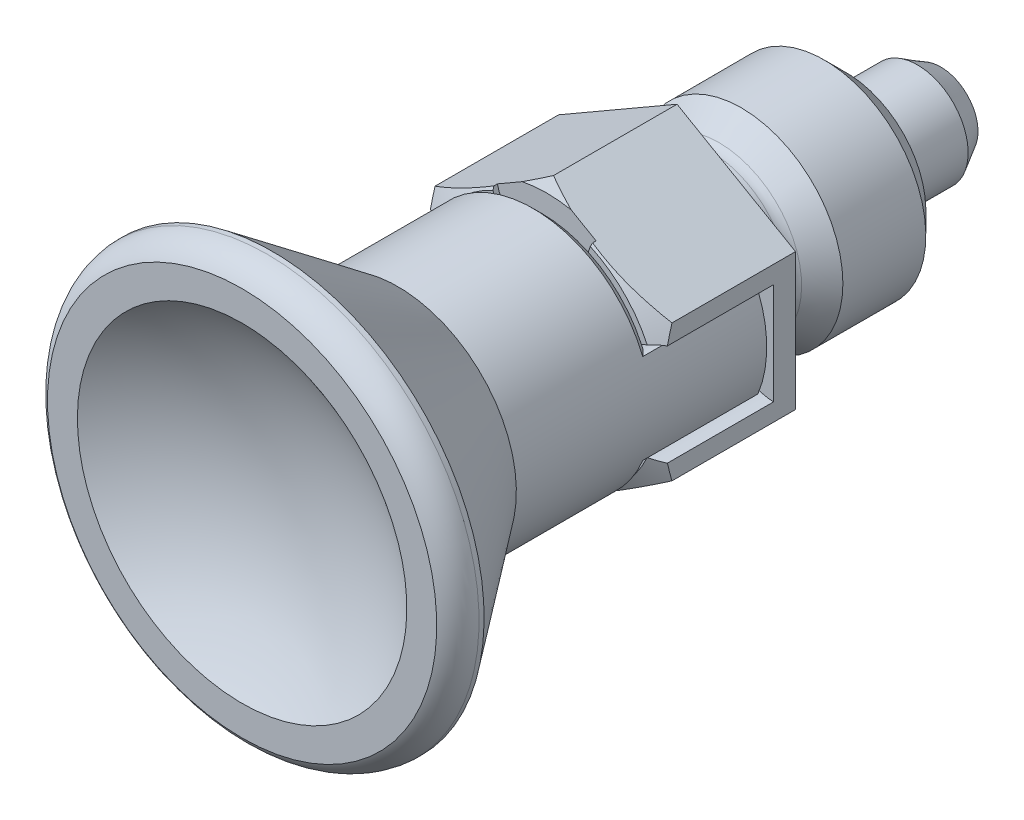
ISO-10303-21;
HEADER;
FILE_DESCRIPTION(('STEP AP214'),'2;1');
FILE_NAME('part.step','',(''),(''),'','','');
FILE_SCHEMA(('AUTOMOTIVE_DESIGN { 1 0 10303 214 1 1 1 1 }'));
ENDSEC;
DATA;
#1=APPLICATION_CONTEXT('core data for automotive mechanical design processes');
#2=APPLICATION_PROTOCOL_DEFINITION('international standard','automotive_design',2000,#1);
#3=PRODUCT_CONTEXT('',#1,'mechanical');
#4=PRODUCT('Part','Part','',(#3));
#5=PRODUCT_RELATED_PRODUCT_CATEGORY('part','',(#4));
#6=PRODUCT_DEFINITION_FORMATION('','',#4);
#7=PRODUCT_DEFINITION_CONTEXT('part definition',#1,'design');
#8=PRODUCT_DEFINITION('design','',#6,#7);
#9=PRODUCT_DEFINITION_SHAPE('','',#8);
#10=(LENGTH_UNIT() NAMED_UNIT(*) SI_UNIT(.MILLI.,.METRE.));
#11=(NAMED_UNIT(*) PLANE_ANGLE_UNIT() SI_UNIT($,.RADIAN.));
#12=(NAMED_UNIT(*) SI_UNIT($,.STERADIAN.) SOLID_ANGLE_UNIT());
#13=UNCERTAINTY_MEASURE_WITH_UNIT(LENGTH_MEASURE(1.E-05),#10,'distance_accuracy_value','');
#14=(GEOMETRIC_REPRESENTATION_CONTEXT(3) GLOBAL_UNCERTAINTY_ASSIGNED_CONTEXT((#13)) GLOBAL_UNIT_ASSIGNED_CONTEXT((#10,
#11,#12)) REPRESENTATION_CONTEXT('',''));
#15=CARTESIAN_POINT('',(0.,0.,0.));
#16=DIRECTION('',(0.,0.,1.));
#17=DIRECTION('',(1.,0.,0.));
#18=AXIS2_PLACEMENT_3D('',#15,#16,#17);
#19=CARTESIAN_POINT('',(0.,0.,-9.9999999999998));
#20=DIRECTION('',(-1.,0.,0.));
#21=DIRECTION('',(0.,1.,0.));
#22=AXIS2_PLACEMENT_3D('',#19,#20,#21);
#23=SPHERICAL_SURFACE('',#22,6.00000000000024);
#24=CARTESIAN_POINT('',(0.,0.,-15.5810746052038));
#25=DIRECTION('',(0.,0.,1.));
#26=DIRECTION('',(0.,-1.,0.));
#27=AXIS2_PLACEMENT_3D('',#24,#25,#26);
#28=CIRCLE('',#27,2.20263620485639);
#29=CARTESIAN_POINT('',(0.,-2.20263620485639,-15.5810746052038));
#30=VERTEX_POINT('',#29);
#31=EDGE_CURVE('E18',#30,#30,#28,.T.);
#32=ORIENTED_EDGE('',*,*,#31,.F.);
#33=EDGE_LOOP('',(#32));
#34=FACE_BOUND('',#33,.T.);
#35=ADVANCED_FACE('F14',(#34),#23,.T.);
#36=CARTESIAN_POINT('',(0.,0.,-14.1999999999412));
#37=DIRECTION('',(0.,0.,1.));
#38=DIRECTION('',(0.,-1.,0.));
#39=AXIS2_PLACEMENT_3D('',#36,#37,#38);
#40=CONICAL_SURFACE('',#39,2.99999999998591,0.523598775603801);
#41=CARTESIAN_POINT('',(0.,0.,-14.2));
#42=DIRECTION('',(0.,0.,1.));
#43=DIRECTION('',(0.,-1.,0.));
#44=AXIS2_PLACEMENT_3D('',#41,#42,#43);
#45=CIRCLE('',#44,3.);
#46=CARTESIAN_POINT('',(0.,-3.,-14.2));
#47=VERTEX_POINT('',#46);
#48=EDGE_CURVE('E890',#47,#47,#45,.T.);
#49=ORIENTED_EDGE('',*,*,#48,.F.);
#50=EDGE_LOOP('',(#49));
#51=FACE_BOUND('',#50,.T.);
#52=ORIENTED_EDGE('',*,*,#31,.T.);
#53=EDGE_LOOP('',(#52));
#54=FACE_BOUND('',#53,.T.);
#55=ADVANCED_FACE('F879',(#51,#54),#40,.T.);
#56=CARTESIAN_POINT('',(0.,0.,-16.));
#57=DIRECTION('',(0.,0.,1.));
#58=DIRECTION('',(0.,-1.,0.));
#59=AXIS2_PLACEMENT_3D('',#56,#57,#58);
#60=CYLINDRICAL_SURFACE('',#59,3.);
#61=CARTESIAN_POINT('',(0.,0.,-10.));
#62=DIRECTION('',(0.,0.,1.));
#63=DIRECTION('',(0.,-1.,0.));
#64=AXIS2_PLACEMENT_3D('',#61,#62,#63);
#65=CIRCLE('',#64,3.);
#66=CARTESIAN_POINT('',(0.,-3.,-10.));
#67=VERTEX_POINT('',#66);
#68=EDGE_CURVE('E893',#67,#67,#65,.F.);
#69=ORIENTED_EDGE('',*,*,#68,.T.);
#70=EDGE_LOOP('',(#69));
#71=FACE_BOUND('',#70,.T.);
#72=ORIENTED_EDGE('',*,*,#48,.T.);
#73=EDGE_LOOP('',(#72));
#74=FACE_BOUND('',#73,.T.);
#75=ADVANCED_FACE('F876',(#71,#74),#60,.T.);
#76=CARTESIAN_POINT('',(4.7,0.,-10.));
#77=DIRECTION('',(0.,0.,1.));
#78=DIRECTION('',(0.,-1.,0.));
#79=AXIS2_PLACEMENT_3D('',#76,#77,#78);
#80=PLANE('',#79);
#81=CARTESIAN_POINT('',(0.,0.,-10.0000000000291));
#82=DIRECTION('',(0.,0.,1.));
#83=DIRECTION('',(0.,-1.,0.));
#84=AXIS2_PLACEMENT_3D('',#81,#82,#83);
#85=CIRCLE('',#84,4.70000000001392);
#86=CARTESIAN_POINT('',(0.,-4.70000000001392,-10.0000000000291));
#87=VERTEX_POINT('',#86);
#88=EDGE_CURVE('E897',#87,#87,#85,.T.);
#89=ORIENTED_EDGE('',*,*,#88,.F.);
#90=EDGE_LOOP('',(#89));
#91=FACE_BOUND('',#90,.T.);
#92=ORIENTED_EDGE('',*,*,#68,.F.);
#93=EDGE_LOOP('',(#92));
#94=FACE_BOUND('',#93,.T.);
#95=ADVANCED_FACE('F872',(#91,#94),#80,.F.);
#96=CARTESIAN_POINT('',(0.,0.,-8.69999999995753));
#97=DIRECTION('',(0.,0.,1.));
#98=DIRECTION('',(0.,-1.,0.));
#99=AXIS2_PLACEMENT_3D('',#96,#97,#98);
#100=CONICAL_SURFACE('',#99,6.00000000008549,0.785398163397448);
#101=CARTESIAN_POINT('',(0.,0.,-8.7));
#102=DIRECTION('',(0.,0.,1.));
#103=DIRECTION('',(0.,-1.,0.));
#104=AXIS2_PLACEMENT_3D('',#101,#102,#103);
#105=CIRCLE('',#104,6.);
#106=CARTESIAN_POINT('',(0.,-6.,-8.7));
#107=VERTEX_POINT('',#106);
#108=EDGE_CURVE('E922',#107,#107,#105,.T.);
#109=ORIENTED_EDGE('',*,*,#108,.F.);
#110=EDGE_LOOP('',(#109));
#111=FACE_BOUND('',#110,.T.);
#112=ORIENTED_EDGE('',*,*,#88,.T.);
#113=EDGE_LOOP('',(#112));
#114=FACE_BOUND('',#113,.T.);
#115=ADVANCED_FACE('F868',(#111,#114),#100,.T.);
#116=CARTESIAN_POINT('',(0.,0.,-10.));
#117=DIRECTION('',(0.,0.,1.));
#118=DIRECTION('',(0.,-1.,0.));
#119=AXIS2_PLACEMENT_3D('',#116,#117,#118);
#120=CYLINDRICAL_SURFACE('',#119,6.);
#121=CARTESIAN_POINT('',(0.,0.,-3.80000000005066));
#122=DIRECTION('',(0.,0.,-1.));
#123=DIRECTION('',(0.,1.,0.));
#124=AXIS2_PLACEMENT_3D('',#121,#122,#123);
#125=CIRCLE('',#124,6.00000000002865);
#126=CARTESIAN_POINT('',(0.,6.00000000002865,-3.80000000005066));
#127=VERTEX_POINT('',#126);
#128=EDGE_CURVE('E925',#127,#127,#125,.F.);
#129=ORIENTED_EDGE('',*,*,#128,.F.);
#130=EDGE_LOOP('',(#129));
#131=FACE_BOUND('',#130,.T.);
#132=ORIENTED_EDGE('',*,*,#108,.T.);
#133=EDGE_LOOP('',(#132));
#134=FACE_BOUND('',#133,.T.);
#135=ADVANCED_FACE('F864',(#131,#134),#120,.T.);
#136=CARTESIAN_POINT('',(0.,0.,-3.80000000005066));
#137=DIRECTION('',(0.,0.,-1.));
#138=DIRECTION('',(0.,1.,0.));
#139=AXIS2_PLACEMENT_3D('',#136,#137,#138);
#140=CONICAL_SURFACE('',#139,6.00000000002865,0.698131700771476);
#141=CARTESIAN_POINT('',(0.,0.,-2.4737742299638));
#142=DIRECTION('',(0.,0.,-1.));
#143=DIRECTION('',(0.,1.,0.));
#144=AXIS2_PLACEMENT_3D('',#141,#142,#143);
#145=CIRCLE('',#144,4.88716444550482);
#146=CARTESIAN_POINT('',(0.,4.88716444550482,-2.4737742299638));
#147=VERTEX_POINT('',#146);
#148=EDGE_CURVE('E851',#147,#147,#145,.T.);
#149=ORIENTED_EDGE('',*,*,#148,.T.);
#150=EDGE_LOOP('',(#149));
#151=FACE_BOUND('',#150,.T.);
#152=ORIENTED_EDGE('',*,*,#128,.T.);
#153=EDGE_LOOP('',(#152));
#154=FACE_BOUND('',#153,.T.);
#155=ADVANCED_FACE('F860',(#151,#154),#140,.T.);
#156=CARTESIAN_POINT('',(0.,0.,-1.95954414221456));
#157=DIRECTION('',(0.,0.,-1.));
#158=DIRECTION('',(0.,1.,0.));
#159=AXIS2_PLACEMENT_3D('',#156,#157,#158);
#160=TOROIDAL_SURFACE('',#159,5.5,0.800000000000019);
#161=CARTESIAN_POINT('',(0.,0.,-1.95954414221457));
#162=DIRECTION('',(0.,0.,1.));
#163=DIRECTION('',(0.,-1.,0.));
#164=AXIS2_PLACEMENT_3D('',#161,#162,#163);
#165=CIRCLE('',#164,4.7);
#166=CARTESIAN_POINT('',(0.,-4.7,-1.95954414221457));
#167=VERTEX_POINT('',#166);
#168=EDGE_CURVE('E843',#167,#167,#165,.T.);
#169=ORIENTED_EDGE('',*,*,#168,.F.);
#170=EDGE_LOOP('',(#169));
#171=FACE_BOUND('',#170,.T.);
#172=ORIENTED_EDGE('',*,*,#148,.F.);
#173=EDGE_LOOP('',(#172));
#174=FACE_BOUND('',#173,.T.);
#175=ADVANCED_FACE('F857',(#171,#174),#160,.F.);
#176=CARTESIAN_POINT('',(0.,0.,-10.));
#177=DIRECTION('',(0.,0.,1.));
#178=DIRECTION('',(0.,-1.,0.));
#179=AXIS2_PLACEMENT_3D('',#176,#177,#178);
#180=CYLINDRICAL_SURFACE('',#179,4.7);
#181=CARTESIAN_POINT('',(0.,0.,-0.8));
#182=DIRECTION('',(0.,0.,-1.));
#183=DIRECTION('',(0.,1.,0.));
#184=AXIS2_PLACEMENT_3D('',#181,#182,#183);
#185=CIRCLE('',#184,4.7);
#186=CARTESIAN_POINT('',(0.,4.7,-0.8));
#187=VERTEX_POINT('',#186);
#188=EDGE_CURVE('E829',#187,#187,#185,.T.);
#189=ORIENTED_EDGE('',*,*,#188,.T.);
#190=EDGE_LOOP('',(#189));
#191=FACE_BOUND('',#190,.T.);
#192=ORIENTED_EDGE('',*,*,#168,.T.);
#193=EDGE_LOOP('',(#192));
#194=FACE_BOUND('',#193,.T.);
#195=ADVANCED_FACE('F835',(#191,#194),#180,.T.);
#196=CARTESIAN_POINT('',(0.,0.,-0.8));
#197=DIRECTION('',(0.,0.,-1.));
#198=DIRECTION('',(0.,1.,0.));
#199=AXIS2_PLACEMENT_3D('',#196,#197,#198);
#200=TOROIDAL_SURFACE('',#199,5.5,0.8);
#201=CARTESIAN_POINT('',(0.,0.,0.));
#202=DIRECTION('',(0.,0.,-1.));
#203=DIRECTION('',(0.,1.,0.));
#204=AXIS2_PLACEMENT_3D('',#201,#202,#203);
#205=CIRCLE('',#204,5.5);
#206=CARTESIAN_POINT('',(0.,5.5,0.));
#207=VERTEX_POINT('',#206);
#208=EDGE_CURVE('E276',#207,#207,#205,.T.);
#209=ORIENTED_EDGE('',*,*,#208,.T.);
#210=EDGE_LOOP('',(#209));
#211=FACE_BOUND('',#210,.T.);
#212=ORIENTED_EDGE('',*,*,#188,.F.);
#213=EDGE_LOOP('',(#212));
#214=FACE_BOUND('',#213,.T.);
#215=ADVANCED_FACE('F831',(#211,#214),#200,.F.);
#216=CARTESIAN_POINT('',(0.,0.,7.29759999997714));
#217=DIRECTION('',(0.,0.,-1.));
#218=DIRECTION('',(0.,1.,0.));
#219=AXIS2_PLACEMENT_3D('',#216,#217,#218);
#220=CONICAL_SURFACE('',#219,8.08706069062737,1.04719755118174);
#221=CARTESIAN_POINT('',(6.6789070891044E-13,8.08290376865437,7.29999999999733));
#222=CARTESIAN_POINT('',(0.119293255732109,8.01402977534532,7.33976233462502));
#223=CARTESIAN_POINT('',(0.23894293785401,7.94494999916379,7.37812290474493));
#224=CARTESIAN_POINT('',(0.478884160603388,7.80641986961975,7.45171424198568));
#225=CARTESIAN_POINT('',(0.599175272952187,7.73696976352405,7.48694687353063));
#226=CARTESIAN_POINT('',(0.840481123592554,7.5976517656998,7.55400717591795));
#227=CARTESIAN_POINT('',(0.961495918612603,7.52778384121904,7.58583457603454));
#228=CARTESIAN_POINT('',(1.20428680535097,7.38760845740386,7.64578355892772));
#229=CARTESIAN_POINT('',(1.32606331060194,7.31730075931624,7.6739029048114));
#230=CARTESIAN_POINT('',(1.4481715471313,7.24680153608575,7.70000000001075));
#231=B_SPLINE_CURVE_WITH_KNOTS('',3,(#221,#222,#223,#224,#225,#226,#227,#228,#229,#230),
.UNSPECIFIED.,.F.,.F.,(4,2,2,2,4),(0.,0.43011843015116,0.859978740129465,1.28987319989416,
1.72002581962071),.UNSPECIFIED.);
#232=CARTESIAN_POINT('',(3.33967735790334E-13,8.08290376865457,7.29999999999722));
#233=VERTEX_POINT('',#232);
#234=CARTESIAN_POINT('',(1.44817154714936,7.24680153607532,7.7000000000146));
#235=VERTEX_POINT('',#234);
#236=EDGE_CURVE('E197',#233,#235,#231,.T.);
#237=ORIENTED_EDGE('',*,*,#236,.F.);
#238=CARTESIAN_POINT('',(-1.4481715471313,7.24680153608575,7.70000000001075));
#239=CARTESIAN_POINT('',(-1.32606331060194,7.31730075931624,7.6739029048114));
#240=CARTESIAN_POINT('',(-1.20428680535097,7.38760845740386,7.64578355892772));
#241=CARTESIAN_POINT('',(-0.961495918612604,7.52778384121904,7.58583457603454));
#242=CARTESIAN_POINT('',(-0.840481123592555,7.5976517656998,7.55400717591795));
#243=CARTESIAN_POINT('',(-0.599175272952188,7.73696976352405,7.48694687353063));
#244=CARTESIAN_POINT('',(-0.47888416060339,7.80641986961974,7.45171424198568));
#245=CARTESIAN_POINT('',(-0.238942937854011,7.94494999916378,7.37812290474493));
#246=CARTESIAN_POINT('',(-0.11929325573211,8.01402977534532,7.33976233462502));
#247=CARTESIAN_POINT('',(-6.69663957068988E-13,8.08290376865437,7.29999999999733));
#248=B_SPLINE_CURVE_WITH_KNOTS('',3,(#238,#239,#240,#241,#242,#243,#244,#245,#246,#247),
.UNSPECIFIED.,.F.,.F.,(4,2,2,2,4),(0.,0.430152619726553,0.860047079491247,1.28990738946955,
1.72002581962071),.UNSPECIFIED.);
#249=CARTESIAN_POINT('',(-1.44817154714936,7.24680153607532,7.7000000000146));
#250=VERTEX_POINT('',#249);
#251=EDGE_CURVE('E261',#250,#233,#248,.T.);
#252=ORIENTED_EDGE('',*,*,#251,.F.);
#253=CARTESIAN_POINT('',(0.,0.,7.70000000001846));
#254=DIRECTION('',(0.,0.,-1.));
#255=DIRECTION('',(0.,1.,0.));
#256=AXIS2_PLACEMENT_3D('',#253,#254,#255);
#257=CIRCLE('',#256,7.39008344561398);
#258=EDGE_CURVE('E265',#235,#250,#257,.F.);
#259=ORIENTED_EDGE('',*,*,#258,.F.);
#260=EDGE_LOOP('',(#237,#252,#259));
#261=FACE_BOUND('',#260,.T.);
#262=ADVANCED_FACE('F306',(#261),#220,.T.);
#263=CARTESIAN_POINT('',(0.,0.,7.29759999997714));
#264=DIRECTION('',(0.,0.,-1.));
#265=DIRECTION('',(0.,1.,0.));
#266=AXIS2_PLACEMENT_3D('',#263,#264,#265);
#267=CONICAL_SURFACE('',#266,8.08706069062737,1.04719755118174);
#268=CARTESIAN_POINT('',(-6.73909296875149E-13,-8.08290376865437,7.29999999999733));
#269=CARTESIAN_POINT('',(-0.119293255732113,-8.01402977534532,7.33976233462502));
#270=CARTESIAN_POINT('',(-0.238942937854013,-7.94494999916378,7.37812290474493));
#271=CARTESIAN_POINT('',(-0.47888416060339,-7.80641986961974,7.45171424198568));
#272=CARTESIAN_POINT('',(-0.599175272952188,-7.73696976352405,7.48694687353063));
#273=CARTESIAN_POINT('',(-0.840481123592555,-7.5976517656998,7.55400717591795));
#274=CARTESIAN_POINT('',(-0.961495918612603,-7.52778384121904,7.58583457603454));
#275=CARTESIAN_POINT('',(-1.20428680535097,-7.38760845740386,7.64578355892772));
#276=CARTESIAN_POINT('',(-1.32606331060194,-7.31730075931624,7.6739029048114));
#277=CARTESIAN_POINT('',(-1.4481715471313,-7.24680153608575,7.70000000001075));
#278=B_SPLINE_CURVE_WITH_KNOTS('',3,(#268,#269,#270,#271,#272,#273,#274,#275,#276,#277),
.UNSPECIFIED.,.F.,.F.,(4,2,2,2,4),(0.,0.430118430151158,0.859978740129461,1.28987319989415,
1.7200258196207),.UNSPECIFIED.);
#279=CARTESIAN_POINT('',(-3.39648637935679E-13,-8.08290376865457,7.29999999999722));
#280=VERTEX_POINT('',#279);
#281=CARTESIAN_POINT('',(-1.44817154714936,-7.24680153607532,7.7000000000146));
#282=VERTEX_POINT('',#281);
#283=EDGE_CURVE('E241',#280,#282,#278,.T.);
#284=ORIENTED_EDGE('',*,*,#283,.F.);
#285=CARTESIAN_POINT('',(1.4481715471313,-7.24680153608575,7.70000000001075));
#286=CARTESIAN_POINT('',(1.32606331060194,-7.31730075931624,7.6739029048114));
#287=CARTESIAN_POINT('',(1.20428680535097,-7.38760845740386,7.64578355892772));
#288=CARTESIAN_POINT('',(0.961495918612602,-7.52778384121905,7.58583457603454));
#289=CARTESIAN_POINT('',(0.840481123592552,-7.5976517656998,7.55400717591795));
#290=CARTESIAN_POINT('',(0.599175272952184,-7.73696976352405,7.48694687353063));
#291=CARTESIAN_POINT('',(0.478884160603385,-7.80641986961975,7.45171424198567));
#292=CARTESIAN_POINT('',(0.238942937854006,-7.94494999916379,7.37812290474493));
#293=CARTESIAN_POINT('',(0.119293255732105,-8.01402977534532,7.33976233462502));
#294=CARTESIAN_POINT('',(6.6428609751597E-13,-8.08290376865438,7.29999999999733));
#295=B_SPLINE_CURVE_WITH_KNOTS('',3,(#285,#286,#287,#288,#289,#290,#291,#292,#293,#294),
.UNSPECIFIED.,.F.,.F.,(4,2,2,2,4),(0.,0.430152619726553,0.86004707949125,1.28990738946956,
1.72002581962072),.UNSPECIFIED.);
#296=CARTESIAN_POINT('',(1.44817154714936,-7.24680153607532,7.7000000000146));
#297=VERTEX_POINT('',#296);
#298=EDGE_CURVE('E312',#297,#280,#295,.T.);
#299=ORIENTED_EDGE('',*,*,#298,.F.);
#300=CARTESIAN_POINT('',(0.,0.,7.70000000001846));
#301=DIRECTION('',(0.,0.,-1.));
#302=DIRECTION('',(0.,1.,0.));
#303=AXIS2_PLACEMENT_3D('',#300,#301,#302);
#304=CIRCLE('',#303,7.39008344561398);
#305=EDGE_CURVE('E327',#282,#297,#304,.F.);
#306=ORIENTED_EDGE('',*,*,#305,.F.);
#307=EDGE_LOOP('',(#284,#299,#306));
#308=FACE_BOUND('',#307,.T.);
#309=ADVANCED_FACE('F300',(#308),#267,.T.);
#310=CARTESIAN_POINT('',(19.,0.,0.));
#311=DIRECTION('',(0.,0.,1.));
#312=DIRECTION('',(0.,-1.,0.));
#313=AXIS2_PLACEMENT_3D('',#310,#311,#312);
#314=PLANE('',#313);
#315=DIRECTION('',(-0.866025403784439,0.5,0.));
#316=VECTOR('',#315,1.);
#317=CARTESIAN_POINT('',(7.,4.04145188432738,0.));
#318=LINE('',#317,#316);
#319=CARTESIAN_POINT('',(7.,4.04145188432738,0.));
#320=VERTEX_POINT('',#319);
#321=CARTESIAN_POINT('',(0.,8.08290376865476,0.));
#322=VERTEX_POINT('',#321);
#323=EDGE_CURVE('E205',#320,#322,#318,.T.);
#324=ORIENTED_EDGE('',*,*,#323,.F.);
#325=DIRECTION('',(0.,1.,0.));
#326=VECTOR('',#325,1.);
#327=CARTESIAN_POINT('',(7.,-4.04145188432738,0.));
#328=LINE('',#327,#326);
#329=CARTESIAN_POINT('',(7.,-4.04145188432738,0.));
#330=VERTEX_POINT('',#329);
#331=EDGE_CURVE('E278',#330,#320,#328,.T.);
#332=ORIENTED_EDGE('',*,*,#331,.F.);
#333=DIRECTION('',(0.866025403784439,0.5,0.));
#334=VECTOR('',#333,1.);
#335=CARTESIAN_POINT('',(0.,-8.08290376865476,0.));
#336=LINE('',#335,#334);
#337=CARTESIAN_POINT('',(0.,-8.08290376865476,0.));
#338=VERTEX_POINT('',#337);
#339=EDGE_CURVE('E218',#338,#330,#336,.T.);
#340=ORIENTED_EDGE('',*,*,#339,.F.);
#341=DIRECTION('',(0.866025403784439,-0.5,0.));
#342=VECTOR('',#341,1.);
#343=CARTESIAN_POINT('',(-7.,-4.04145188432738,0.));
#344=LINE('',#343,#342);
#345=CARTESIAN_POINT('',(-7.,-4.04145188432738,0.));
#346=VERTEX_POINT('',#345);
#347=EDGE_CURVE('E236',#346,#338,#344,.T.);
#348=ORIENTED_EDGE('',*,*,#347,.F.);
#349=DIRECTION('',(0.,-1.,0.));
#350=VECTOR('',#349,1.);
#351=CARTESIAN_POINT('',(-7.,4.04145188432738,0.));
#352=LINE('',#351,#350);
#353=CARTESIAN_POINT('',(-7.,4.04145188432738,0.));
#354=VERTEX_POINT('',#353);
#355=EDGE_CURVE('E226',#354,#346,#352,.T.);
#356=ORIENTED_EDGE('',*,*,#355,.F.);
#357=DIRECTION('',(-0.866025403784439,-0.5,0.));
#358=VECTOR('',#357,1.);
#359=CARTESIAN_POINT('',(0.,8.08290376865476,0.));
#360=LINE('',#359,#358);
#361=EDGE_CURVE('E257',#322,#354,#360,.T.);
#362=ORIENTED_EDGE('',*,*,#361,.F.);
#363=EDGE_LOOP('',(#324,#332,#340,#348,#356,#362));
#364=FACE_BOUND('',#363,.T.);
#365=ORIENTED_EDGE('',*,*,#208,.F.);
#366=EDGE_LOOP('',(#365));
#367=FACE_BOUND('',#366,.T.);
#368=ADVANCED_FACE('F237',(#364,#367),#314,.F.);
#369=CARTESIAN_POINT('',(7.,4.04145188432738,0.));
#370=DIRECTION('',(0.5,0.866025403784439,0.));
#371=DIRECTION('',(-0.866025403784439,0.5,0.));
#372=AXIS2_PLACEMENT_3D('',#369,#370,#371);
#373=PLANE('',#372);
#374=ORIENTED_EDGE('',*,*,#236,.T.);
#375=DIRECTION('',(-0.866025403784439,0.5,0.));
#376=VECTOR('',#375,1.);
#377=CARTESIAN_POINT('',(2.91690844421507,6.3988258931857,7.7));
#378=LINE('',#377,#376);
#379=CARTESIAN_POINT('',(2.91690844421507,6.3988258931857,7.7));
#380=VERTEX_POINT('',#379);
#381=EDGE_CURVE('E271',#380,#235,#378,.T.);
#382=ORIENTED_EDGE('',*,*,#381,.F.);
#383=DIRECTION('',(0.,0.,1.));
#384=VECTOR('',#383,1.);
#385=CARTESIAN_POINT('',(2.91690844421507,6.3988258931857,0.));
#386=LINE('',#385,#384);
#387=CARTESIAN_POINT('',(2.91690844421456,6.39882589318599,7.90656290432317));
#388=VERTEX_POINT('',#387);
#389=EDGE_CURVE('E274',#380,#388,#386,.T.);
#390=ORIENTED_EDGE('',*,*,#389,.T.);
#391=CARTESIAN_POINT('',(7.00000002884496,4.04145186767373,7.29999999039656));
#392=CARTESIAN_POINT('',(6.66791805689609,4.23317948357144,7.41069440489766));
#393=CARTESIAN_POINT('',(6.33293215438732,4.4265836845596,7.51056076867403));
#394=CARTESIAN_POINT('',(5.82768758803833,4.71828677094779,7.63876608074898));
#395=CARTESIAN_POINT('',(5.65942018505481,4.81543600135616,7.67780032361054));
#396=CARTESIAN_POINT('',(5.32166719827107,5.01043777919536,7.74804462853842));
#397=CARTESIAN_POINT('',(5.15218176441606,5.10829024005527,7.77925563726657));
#398=CARTESIAN_POINT('',(4.8118903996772,5.30475755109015,7.8331342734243));
#399=CARTESIAN_POINT('',(4.64108269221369,5.40337342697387,7.85578703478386));
#400=CARTESIAN_POINT('',(4.29873158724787,5.60102992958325,7.89184387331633));
#401=CARTESIAN_POINT('',(4.12718819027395,5.70007055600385,7.90524795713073));
#402=CARTESIAN_POINT('',(3.78247092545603,5.89909316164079,7.92246377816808));
#403=CARTESIAN_POINT('',(3.60929431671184,5.99907672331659,7.92620455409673));
#404=CARTESIAN_POINT('',(3.3495664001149,6.1490307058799,7.92438357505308));
#405=CARTESIAN_POINT('',(3.26298459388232,6.1990187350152,7.92253712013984));
#406=CARTESIAN_POINT('',(3.08988626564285,6.29895710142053,7.91638727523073));
#407=CARTESIAN_POINT('',(3.00336974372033,6.34890743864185,7.9120838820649));
#408=CARTESIAN_POINT('',(2.91690844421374,6.39882589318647,7.90656290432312));
#409=B_SPLINE_CURVE_WITH_KNOTS('',3,(#391,#392,#393,#394,#395,#396,#397,#398,#399,#400,#401,
#402,#403,#404,#405,#406,#407,#408),.UNSPECIFIED.,.F.,.F.,(4,2,2,2,2,2,2,2,4),(0.,
1.19734735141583,1.79177207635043,2.386124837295,2.98150532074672,3.57688537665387,
4.17662526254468,4.47657838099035,4.77653188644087),.UNSPECIFIED.);
#410=CARTESIAN_POINT('',(7.00000001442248,4.04145187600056,7.29999999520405));
#411=VERTEX_POINT('',#410);
#412=EDGE_CURVE('E415',#411,#388,#409,.T.);
#413=ORIENTED_EDGE('',*,*,#412,.F.);
#414=DIRECTION('',(0.,0.,1.));
#415=VECTOR('',#414,1.);
#416=CARTESIAN_POINT('',(7.,4.04145188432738,0.));
#417=LINE('',#416,#415);
#418=EDGE_CURVE('E281',#320,#411,#417,.T.);
#419=ORIENTED_EDGE('',*,*,#418,.F.);
#420=ORIENTED_EDGE('',*,*,#323,.T.);
#421=DIRECTION('',(0.,0.,1.));
#422=VECTOR('',#421,1.);
#423=CARTESIAN_POINT('',(0.,8.08290376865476,0.));
#424=LINE('',#423,#422);
#425=EDGE_CURVE('E258',#233,#322,#424,.F.);
#426=ORIENTED_EDGE('',*,*,#425,.F.);
#427=EDGE_LOOP('',(#374,#382,#390,#413,#419,#420,#426));
#428=FACE_BOUND('',#427,.T.);
#429=ADVANCED_FACE('F299',(#428),#373,.T.);
#430=CARTESIAN_POINT('',(0.,0.,7.7));
#431=DIRECTION('',(0.,0.,1.));
#432=DIRECTION('',(0.,-1.,0.));
#433=AXIS2_PLACEMENT_3D('',#430,#431,#432);
#434=PLANE('',#433);
#435=ORIENTED_EDGE('',*,*,#258,.T.);
#436=DIRECTION('',(-0.866025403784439,-0.5,0.));
#437=VECTOR('',#436,1.);
#438=CARTESIAN_POINT('',(0.,8.08290376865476,7.7));
#439=LINE('',#438,#437);
#440=CARTESIAN_POINT('',(-2.91690844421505,6.39882589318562,7.7));
#441=VERTEX_POINT('',#440);
#442=EDGE_CURVE('E262',#441,#250,#439,.F.);
#443=ORIENTED_EDGE('',*,*,#442,.F.);
#444=CARTESIAN_POINT('',(0.,7.1,7.7));
#445=DIRECTION('',(0.,0.,-1.));
#446=DIRECTION('',(0.,1.,0.));
#447=AXIS2_PLACEMENT_3D('',#444,#445,#446);
#448=CIRCLE('',#447,3.);
#449=EDGE_CURVE('E422',#441,#380,#448,.F.);
#450=ORIENTED_EDGE('',*,*,#449,.T.);
#451=ORIENTED_EDGE('',*,*,#381,.T.);
#452=EDGE_LOOP('',(#435,#443,#450,#451));
#453=FACE_BOUND('',#452,.T.);
#454=ADVANCED_FACE('F954',(#453),#434,.T.);
#455=CARTESIAN_POINT('',(0.,8.08290376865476,0.));
#456=DIRECTION('',(-0.5,0.866025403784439,0.));
#457=DIRECTION('',(-0.866025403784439,-0.5,0.));
#458=AXIS2_PLACEMENT_3D('',#455,#456,#457);
#459=PLANE('',#458);
#460=DIRECTION('',(0.,0.,1.));
#461=VECTOR('',#460,1.);
#462=CARTESIAN_POINT('',(-7.,4.04145188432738,0.));
#463=LINE('',#462,#461);
#464=CARTESIAN_POINT('',(-7.,4.04145184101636,7.30000001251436));
#465=VERTEX_POINT('',#464);
#466=EDGE_CURVE('E233',#465,#354,#463,.F.);
#467=ORIENTED_EDGE('',*,*,#466,.F.);
#468=CARTESIAN_POINT('',(-2.91690849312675,6.39882586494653,7.90656290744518));
#469=CARTESIAN_POINT('',(-3.0555719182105,6.31876849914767,7.91543643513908));
#470=CARTESIAN_POINT('',(-3.19438731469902,6.23862339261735,7.92114671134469));
#471=CARTESIAN_POINT('',(-3.47209462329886,6.07828900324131,7.92622528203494));
#472=CARTESIAN_POINT('',(-3.61098652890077,5.99809972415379,7.92559405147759));
#473=CARTESIAN_POINT('',(-3.88845966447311,5.83790053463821,7.91798041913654));
#474=CARTESIAN_POINT('',(-4.02704106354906,5.75789052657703,7.91100628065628));
#475=CARTESIAN_POINT('',(-4.30385966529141,5.59806923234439,7.89087107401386));
#476=CARTESIAN_POINT('',(-4.44209686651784,5.51825794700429,7.87770998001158));
#477=CARTESIAN_POINT('',(-4.8532530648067,5.28087680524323,7.82961985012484));
#478=CARTESIAN_POINT('',(-5.12543341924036,5.12373340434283,7.78599707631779));
#479=CARTESIAN_POINT('',(-5.66668909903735,4.81123929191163,7.6783026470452));
#480=CARTESIAN_POINT('',(-5.93576413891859,4.65588874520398,7.61422912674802));
#481=CARTESIAN_POINT('',(-6.33659288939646,4.42447015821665,7.5054070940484));
#482=CARTESIAN_POINT('',(-6.46967873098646,4.34763301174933,7.46703475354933));
#483=CARTESIAN_POINT('',(-6.66881974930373,4.23265889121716,7.40655382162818));
#484=CARTESIAN_POINT('',(-6.7352019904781,4.19433308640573,7.3858785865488));
#485=CARTESIAN_POINT('',(-6.86775895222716,4.11780128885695,7.34361271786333));
#486=CARTESIAN_POINT('',(-6.93393363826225,4.07959531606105,7.32202193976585));
#487=CARTESIAN_POINT('',(-7.00000002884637,4.04145186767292,7.29999999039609));
#488=B_SPLINE_CURVE_WITH_KNOTS('',3,(#468,#469,#470,#471,#472,#473,#474,#475,#476,#477,#478,
#479,#480,#481,#482,#483,#484,#485,#486,#487),.UNSPECIFIED.,.F.,.F.,(4,2,2,2,2,2,2,2,2,4),(0.,
0.481050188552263,0.962064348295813,1.44245275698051,1.92284317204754,2.87388851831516,
3.82502061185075,4.30015555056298,4.53832294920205,4.77652807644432),.UNSPECIFIED.);
#489=CARTESIAN_POINT('',(-2.91690846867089,6.39882587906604,7.90656290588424));
#490=VERTEX_POINT('',#489);
#491=EDGE_CURVE('E447',#490,#465,#488,.T.);
#492=ORIENTED_EDGE('',*,*,#491,.F.);
#493=DIRECTION('',(0.,0.,-1.));
#494=VECTOR('',#493,1.);
#495=CARTESIAN_POINT('',(-2.91690844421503,6.39882589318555,7.7));
#496=LINE('',#495,#494);
#497=EDGE_CURVE('E266',#490,#441,#496,.T.);
#498=ORIENTED_EDGE('',*,*,#497,.T.);
#499=ORIENTED_EDGE('',*,*,#442,.T.);
#500=ORIENTED_EDGE('',*,*,#251,.T.);
#501=ORIENTED_EDGE('',*,*,#425,.T.);
#502=ORIENTED_EDGE('',*,*,#361,.T.);
#503=EDGE_LOOP('',(#467,#492,#498,#499,#500,#501,#502));
#504=FACE_BOUND('',#503,.T.);
#505=ADVANCED_FACE('F823',(#504),#459,.T.);
#506=CARTESIAN_POINT('',(0.,0.,1.3));
#507=DIRECTION('',(0.,0.,1.));
#508=DIRECTION('',(0.,-1.,0.));
#509=AXIS2_PLACEMENT_3D('',#506,#507,#508);
#510=PLANE('',#509);
#511=CARTESIAN_POINT('',(-7.1,0.,1.3));
#512=DIRECTION('',(0.,0.,-1.));
#513=DIRECTION('',(0.,1.,0.));
#514=AXIS2_PLACEMENT_3D('',#511,#512,#513);
#515=CIRCLE('',#514,3.);
#516=CARTESIAN_POINT('',(-7.,-2.99833287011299,1.3));
#517=VERTEX_POINT('',#516);
#518=CARTESIAN_POINT('',(-7.,2.99833287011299,1.3));
#519=VERTEX_POINT('',#518);
#520=EDGE_CURVE('E475',#517,#519,#515,.F.);
#521=ORIENTED_EDGE('',*,*,#520,.T.);
#522=DIRECTION('',(0.,-1.,0.));
#523=VECTOR('',#522,1.);
#524=CARTESIAN_POINT('',(-7.,4.04145188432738,1.3));
#525=LINE('',#524,#523);
#526=EDGE_CURVE('E254',#517,#519,#525,.F.);
#527=ORIENTED_EDGE('',*,*,#526,.F.);
#528=EDGE_LOOP('',(#521,#527));
#529=FACE_BOUND('',#528,.T.);
#530=ADVANCED_FACE('F953',(#529),#510,.T.);
#531=CARTESIAN_POINT('',(-7.,4.04145188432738,0.));
#532=DIRECTION('',(-1.,0.,0.));
#533=DIRECTION('',(0.,-1.,0.));
#534=AXIS2_PLACEMENT_3D('',#531,#532,#533);
#535=PLANE('',#534);
#536=DIRECTION('',(0.,0.,1.));
#537=VECTOR('',#536,1.);
#538=CARTESIAN_POINT('',(-7.,-4.04145188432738,0.));
#539=LINE('',#538,#537);
#540=CARTESIAN_POINT('',(-7.,-4.04145188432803,7.30000000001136));
#541=VERTEX_POINT('',#540);
#542=EDGE_CURVE('E230',#541,#346,#539,.F.);
#543=ORIENTED_EDGE('',*,*,#542,.F.);
#544=CARTESIAN_POINT('',(-7.,-4.04145188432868,7.30000000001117));
#545=CARTESIAN_POINT('',(-7.,-3.95516211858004,7.324909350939));
#546=CARTESIAN_POINT('',(-7.,-3.86871216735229,7.34926732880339));
#547=CARTESIAN_POINT('',(-7.,-3.69550766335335,7.39680268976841));
#548=CARTESIAN_POINT('',(-7.,-3.60875317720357,7.41998031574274));
#549=CARTESIAN_POINT('',(-7.,-3.43491814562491,7.46508788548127));
#550=CARTESIAN_POINT('',(-7.,-3.34783759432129,7.48701780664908));
#551=CARTESIAN_POINT('',(-7.,-3.17333583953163,7.52955783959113));
#552=CARTESIAN_POINT('',(-7.,-3.085914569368,7.55016767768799));
#553=CARTESIAN_POINT('',(-7.,-2.99833285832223,7.57007708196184));
#554=B_SPLINE_CURVE_WITH_KNOTS('',3,(#544,#545,#546,#547,#548,#549,#550,#551,#552,#553),
.UNSPECIFIED.,.F.,.F.,(4,2,2,2,4),(0.,0.269438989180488,0.538822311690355,0.808210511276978,
1.07765438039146),.UNSPECIFIED.);
#555=CARTESIAN_POINT('',(-7.,-2.99833286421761,7.57007708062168));
#556=VERTEX_POINT('',#555);
#557=EDGE_CURVE('E234',#541,#556,#554,.T.);
#558=ORIENTED_EDGE('',*,*,#557,.T.);
#559=DIRECTION('',(0.,0.,-1.));
#560=VECTOR('',#559,1.);
#561=CARTESIAN_POINT('',(-7.,-2.99833287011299,1.3));
#562=LINE('',#561,#560);
#563=EDGE_CURVE('E481',#556,#517,#562,.T.);
#564=ORIENTED_EDGE('',*,*,#563,.T.);
#565=ORIENTED_EDGE('',*,*,#526,.T.);
#566=DIRECTION('',(0.,0.,-1.));
#567=VECTOR('',#566,1.);
#568=CARTESIAN_POINT('',(-7.,2.99833287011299,1.3));
#569=LINE('',#568,#567);
#570=CARTESIAN_POINT('',(-7.,2.99833288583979,7.57007707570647));
#571=VERTEX_POINT('',#570);
#572=EDGE_CURVE('E469',#519,#571,#569,.F.);
#573=ORIENTED_EDGE('',*,*,#572,.T.);
#574=CARTESIAN_POINT('',(-7.,4.04145179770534,7.30000002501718));
#575=CARTESIAN_POINT('',(-7.,3.95516204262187,7.324909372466));
#576=CARTESIAN_POINT('',(-7.,3.86871210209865,7.34926734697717));
#577=CARTESIAN_POINT('',(-7.,3.6955076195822,7.39680270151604));
#578=CARTESIAN_POINT('',(-7.,3.60875314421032,7.41998032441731));
#579=CARTESIAN_POINT('',(-7.,3.43491813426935,7.46508788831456));
#580=CARTESIAN_POINT('',(-7.,3.34783759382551,7.48701780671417));
#581=CARTESIAN_POINT('',(-7.,3.17333586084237,7.52955783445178));
#582=CARTESIAN_POINT('',(-7.,3.08591460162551,7.55016767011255));
#583=CARTESIAN_POINT('',(-7.,2.99833290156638,7.57007707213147));
#584=B_SPLINE_CURVE_WITH_KNOTS('',3,(#574,#575,#576,#577,#578,#579,#580,#581,#582,#583),
.UNSPECIFIED.,.F.,.F.,(4,2,2,2,4),(0.,0.26943895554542,0.538822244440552,0.808210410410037,
1.07765424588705),.UNSPECIFIED.);
#585=EDGE_CURVE('E269',#465,#571,#584,.T.);
#586=ORIENTED_EDGE('',*,*,#585,.F.);
#587=ORIENTED_EDGE('',*,*,#466,.T.);
#588=ORIENTED_EDGE('',*,*,#355,.T.);
#589=EDGE_LOOP('',(#543,#558,#564,#565,#573,#586,#587,#588));
#590=FACE_BOUND('',#589,.T.);
#591=ADVANCED_FACE('F228',(#590),#535,.T.);
#592=CARTESIAN_POINT('',(-7.,-4.04145188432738,0.));
#593=DIRECTION('',(-0.5,-0.866025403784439,0.));
#594=DIRECTION('',(0.866025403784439,-0.5,0.));
#595=AXIS2_PLACEMENT_3D('',#592,#593,#594);
#596=PLANE('',#595);
#597=ORIENTED_EDGE('',*,*,#283,.T.);
#598=DIRECTION('',(0.866025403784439,-0.5,0.));
#599=VECTOR('',#598,1.);
#600=CARTESIAN_POINT('',(-2.91690844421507,-6.3988258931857,7.7));
#601=LINE('',#600,#599);
#602=CARTESIAN_POINT('',(-2.91690844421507,-6.3988258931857,7.7));
#603=VERTEX_POINT('',#602);
#604=EDGE_CURVE('E250',#603,#282,#601,.T.);
#605=ORIENTED_EDGE('',*,*,#604,.F.);
#606=DIRECTION('',(0.,0.,1.));
#607=VECTOR('',#606,1.);
#608=CARTESIAN_POINT('',(-2.91690844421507,-6.3988258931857,0.));
#609=LINE('',#608,#607);
#610=CARTESIAN_POINT('',(-2.91690844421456,-6.39882589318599,7.90656290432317));
#611=VERTEX_POINT('',#610);
#612=EDGE_CURVE('E246',#603,#611,#609,.T.);
#613=ORIENTED_EDGE('',*,*,#612,.T.);
#614=CARTESIAN_POINT('',(-7.00000000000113,-4.04145188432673,7.30000000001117));
#615=CARTESIAN_POINT('',(-6.66791803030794,-4.23317949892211,7.41069441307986));
#616=CARTESIAN_POINT('',(-6.33293213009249,-4.42658369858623,7.51056077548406));
#617=CARTESIAN_POINT('',(-5.82768756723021,-4.71828678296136,7.63876608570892));
#618=CARTESIAN_POINT('',(-5.65942016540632,-4.81543601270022,7.67780032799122));
#619=CARTESIAN_POINT('',(-5.32166718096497,-5.01043778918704,7.7480446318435));
#620=CARTESIAN_POINT('',(-5.15218174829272,-5.10829024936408,7.77925564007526));
#621=CARTESIAN_POINT('',(-4.81189038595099,-5.30475755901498,7.83313427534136));
#622=CARTESIAN_POINT('',(-4.64108267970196,-5.40337343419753,7.8557870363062));
#623=CARTESIAN_POINT('',(-4.29873157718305,-5.60102993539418,7.89184387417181));
#624=CARTESIAN_POINT('',(-4.12718818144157,-5.70007056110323,7.90524795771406));
#625=CARTESIAN_POINT('',(-3.78247091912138,-5.8990931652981,7.92246377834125));
#626=CARTESIAN_POINT('',(-3.60929431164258,-5.99907672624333,7.92620455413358));
#627=CARTESIAN_POINT('',(-3.34956639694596,-6.14903070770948,7.9243835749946));
#628=CARTESIAN_POINT('',(-3.26298459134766,-6.19901873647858,7.9225371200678));
#629=CARTESIAN_POINT('',(-3.08988626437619,-6.29895710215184,7.9163872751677));
#630=CARTESIAN_POINT('',(-3.00336974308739,-6.34890743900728,7.91208388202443));
#631=CARTESIAN_POINT('',(-2.91690844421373,-6.39882589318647,7.90656290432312));
#632=B_SPLINE_CURVE_WITH_KNOTS('',3,(#614,#615,#616,#617,#618,#619,#620,#621,#622,#623,#624,
#625,#626,#627,#628,#629,#630,#631),.UNSPECIFIED.,.F.,.F.,(4,2,2,2,2,2,2,2,4),(0.,
1.19734734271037,1.79177206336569,2.38612482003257,2.98150529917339,3.57688535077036,
4.17662523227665,4.47657834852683,4.77653185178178),.UNSPECIFIED.);
#633=EDGE_CURVE('E245',#541,#611,#632,.T.);
#634=ORIENTED_EDGE('',*,*,#633,.F.);
#635=ORIENTED_EDGE('',*,*,#542,.T.);
#636=ORIENTED_EDGE('',*,*,#347,.T.);
#637=DIRECTION('',(0.,0.,1.));
#638=VECTOR('',#637,1.);
#639=CARTESIAN_POINT('',(0.,-8.08290376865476,0.));
#640=LINE('',#639,#638);
#641=EDGE_CURVE('E494',#280,#338,#640,.F.);
#642=ORIENTED_EDGE('',*,*,#641,.F.);
#643=EDGE_LOOP('',(#597,#605,#613,#634,#635,#636,#642));
#644=FACE_BOUND('',#643,.T.);
#645=ADVANCED_FACE('F243',(#644),#596,.T.);
#646=CARTESIAN_POINT('',(0.,0.,7.7));
#647=DIRECTION('',(0.,0.,1.));
#648=DIRECTION('',(0.,-1.,0.));
#649=AXIS2_PLACEMENT_3D('',#646,#647,#648);
#650=PLANE('',#649);
#651=ORIENTED_EDGE('',*,*,#305,.T.);
#652=DIRECTION('',(0.866025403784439,0.5,0.));
#653=VECTOR('',#652,1.);
#654=CARTESIAN_POINT('',(0.,-8.08290376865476,7.7));
#655=LINE('',#654,#653);
#656=CARTESIAN_POINT('',(2.91690844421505,-6.39882589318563,7.7));
#657=VERTEX_POINT('',#656);
#658=EDGE_CURVE('E496',#657,#297,#655,.F.);
#659=ORIENTED_EDGE('',*,*,#658,.F.);
#660=CARTESIAN_POINT('',(0.,-7.1,7.7));
#661=DIRECTION('',(0.,0.,-1.));
#662=DIRECTION('',(0.,1.,0.));
#663=AXIS2_PLACEMENT_3D('',#660,#661,#662);
#664=CIRCLE('',#663,3.);
#665=EDGE_CURVE('E349',#657,#603,#664,.F.);
#666=ORIENTED_EDGE('',*,*,#665,.T.);
#667=ORIENTED_EDGE('',*,*,#604,.T.);
#668=EDGE_LOOP('',(#651,#659,#666,#667));
#669=FACE_BOUND('',#668,.T.);
#670=ADVANCED_FACE('F338',(#669),#650,.T.);
#671=CARTESIAN_POINT('',(0.,-8.08290376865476,0.));
#672=DIRECTION('',(0.5,-0.866025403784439,0.));
#673=DIRECTION('',(0.866025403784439,0.5,0.));
#674=AXIS2_PLACEMENT_3D('',#671,#672,#673);
#675=PLANE('',#674);
#676=DIRECTION('',(0.,0.,1.));
#677=VECTOR('',#676,1.);
#678=CARTESIAN_POINT('',(7.,-4.04145188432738,0.));
#679=LINE('',#678,#677);
#680=CARTESIAN_POINT('',(7.,-4.04145184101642,7.30000001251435));
#681=VERTEX_POINT('',#680);
#682=EDGE_CURVE('E282',#681,#330,#679,.F.);
#683=ORIENTED_EDGE('',*,*,#682,.F.);
#684=CARTESIAN_POINT('',(2.91690849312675,-6.39882586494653,7.90656290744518));
#685=CARTESIAN_POINT('',(3.0555719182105,-6.31876849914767,7.91543643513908));
#686=CARTESIAN_POINT('',(3.19438731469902,-6.23862339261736,7.92114671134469));
#687=CARTESIAN_POINT('',(3.47209462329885,-6.07828900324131,7.92622528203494));
#688=CARTESIAN_POINT('',(3.61098652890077,-5.99809972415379,7.92559405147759));
#689=CARTESIAN_POINT('',(3.88845966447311,-5.83790053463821,7.91798041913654));
#690=CARTESIAN_POINT('',(4.02704106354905,-5.75789052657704,7.91100628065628));
#691=CARTESIAN_POINT('',(4.30385966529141,-5.59806923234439,7.89087107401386));
#692=CARTESIAN_POINT('',(4.44209686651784,-5.51825794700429,7.87770998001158));
#693=CARTESIAN_POINT('',(4.8532530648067,-5.28087680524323,7.82961985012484));
#694=CARTESIAN_POINT('',(5.12543341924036,-5.12373340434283,7.78599707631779));
#695=CARTESIAN_POINT('',(5.66668909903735,-4.81123929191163,7.6783026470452));
#696=CARTESIAN_POINT('',(5.93576413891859,-4.65588874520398,7.61422912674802));
#697=CARTESIAN_POINT('',(6.33659288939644,-4.42447015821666,7.50540709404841));
#698=CARTESIAN_POINT('',(6.46967873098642,-4.34763301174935,7.46703475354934));
#699=CARTESIAN_POINT('',(6.66881974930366,-4.2326588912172,7.4065538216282));
#700=CARTESIAN_POINT('',(6.73520199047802,-4.19433308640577,7.38587858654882));
#701=CARTESIAN_POINT('',(6.86775895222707,-4.117801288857,7.34361271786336));
#702=CARTESIAN_POINT('',(6.93393363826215,-4.07959531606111,7.32202193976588));
#703=CARTESIAN_POINT('',(7.00000002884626,-4.04145186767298,7.29999999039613));
#704=B_SPLINE_CURVE_WITH_KNOTS('',3,(#684,#685,#686,#687,#688,#689,#690,#691,#692,#693,#694,
#695,#696,#697,#698,#699,#700,#701,#702,#703),.UNSPECIFIED.,.F.,.F.,(4,2,2,2,2,2,2,2,2,4),(0.,
0.481050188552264,0.962064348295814,1.44245275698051,1.92284317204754,2.87388851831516,
3.82502061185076,4.30015555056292,4.53832294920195,4.77652807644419),.UNSPECIFIED.);
#705=CARTESIAN_POINT('',(2.91690846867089,-6.39882587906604,7.90656290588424));
#706=VERTEX_POINT('',#705);
#707=EDGE_CURVE('E504',#706,#681,#704,.T.);
#708=ORIENTED_EDGE('',*,*,#707,.F.);
#709=DIRECTION('',(0.,0.,-1.));
#710=VECTOR('',#709,1.);
#711=CARTESIAN_POINT('',(2.91690844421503,-6.39882589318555,7.7));
#712=LINE('',#711,#710);
#713=EDGE_CURVE('E380',#706,#657,#712,.T.);
#714=ORIENTED_EDGE('',*,*,#713,.T.);
#715=ORIENTED_EDGE('',*,*,#658,.T.);
#716=ORIENTED_EDGE('',*,*,#298,.T.);
#717=ORIENTED_EDGE('',*,*,#641,.T.);
#718=ORIENTED_EDGE('',*,*,#339,.T.);
#719=EDGE_LOOP('',(#683,#708,#714,#715,#716,#717,#718));
#720=FACE_BOUND('',#719,.T.);
#721=ADVANCED_FACE('F501',(#720),#675,.T.);
#722=CARTESIAN_POINT('',(0.,0.,1.3));
#723=DIRECTION('',(0.,0.,1.));
#724=DIRECTION('',(0.,-1.,0.));
#725=AXIS2_PLACEMENT_3D('',#722,#723,#724);
#726=PLANE('',#725);
#727=CARTESIAN_POINT('',(7.1,0.,1.3));
#728=DIRECTION('',(0.,0.,-1.));
#729=DIRECTION('',(0.,1.,0.));
#730=AXIS2_PLACEMENT_3D('',#727,#728,#729);
#731=CIRCLE('',#730,3.);
#732=CARTESIAN_POINT('',(7.,2.99833287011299,1.3));
#733=VERTEX_POINT('',#732);
#734=CARTESIAN_POINT('',(7.,-2.99833287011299,1.3));
#735=VERTEX_POINT('',#734);
#736=EDGE_CURVE('E553',#733,#735,#731,.F.);
#737=ORIENTED_EDGE('',*,*,#736,.T.);
#738=DIRECTION('',(0.,1.,0.));
#739=VECTOR('',#738,1.);
#740=CARTESIAN_POINT('',(7.,-4.04145188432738,1.3));
#741=LINE('',#740,#739);
#742=EDGE_CURVE('E491',#733,#735,#741,.F.);
#743=ORIENTED_EDGE('',*,*,#742,.F.);
#744=EDGE_LOOP('',(#737,#743));
#745=FACE_BOUND('',#744,.T.);
#746=ADVANCED_FACE('F403',(#745),#726,.T.);
#747=CARTESIAN_POINT('',(7.,-4.04145188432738,0.));
#748=DIRECTION('',(1.,0.,0.));
#749=DIRECTION('',(0.,1.,0.));
#750=AXIS2_PLACEMENT_3D('',#747,#748,#749);
#751=PLANE('',#750);
#752=ORIENTED_EDGE('',*,*,#418,.T.);
#753=CARTESIAN_POINT('',(7.,2.99833287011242,7.57007707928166));
#754=CARTESIAN_POINT('',(7.,3.08591457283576,7.55016767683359));
#755=CARTESIAN_POINT('',(7.,3.17333583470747,7.52955784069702));
#756=CARTESIAN_POINT('',(7.,3.34783757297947,7.48701781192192));
#757=CARTESIAN_POINT('',(7.,3.43491811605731,7.46508789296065));
#758=CARTESIAN_POINT('',(7.,3.60875313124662,7.41998032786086));
#759=CARTESIAN_POINT('',(7.,3.6955076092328,7.39680270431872));
#760=CARTESIAN_POINT('',(7.,3.86871209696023,7.34926734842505));
#761=CARTESIAN_POINT('',(7.,3.9551620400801,7.32490937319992));
#762=CARTESIAN_POINT('',(7.,4.04145179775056,7.30000002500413));
#763=B_SPLINE_CURVE_WITH_KNOTS('',3,(#753,#754,#755,#756,#757,#758,#759,#760,#761,#762),
.UNSPECIFIED.,.F.,.F.,(4,2,2,2,4),(0.,0.269443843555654,0.538832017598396,0.808215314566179,
1.07765427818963),.UNSPECIFIED.);
#764=CARTESIAN_POINT('',(6.99999999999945,2.99833287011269,7.57007707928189));
#765=VERTEX_POINT('',#764);
#766=EDGE_CURVE('E408',#765,#411,#763,.T.);
#767=ORIENTED_EDGE('',*,*,#766,.F.);
#768=DIRECTION('',(0.,0.,-1.));
#769=VECTOR('',#768,1.);
#770=CARTESIAN_POINT('',(7.,2.99833287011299,1.3));
#771=LINE('',#770,#769);
#772=EDGE_CURVE('E555',#765,#733,#771,.T.);
#773=ORIENTED_EDGE('',*,*,#772,.T.);
#774=ORIENTED_EDGE('',*,*,#742,.T.);
#775=DIRECTION('',(0.,0.,-1.));
#776=VECTOR('',#775,1.);
#777=CARTESIAN_POINT('',(7.,-2.99833287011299,1.3));
#778=LINE('',#777,#776);
#779=CARTESIAN_POINT('',(7.,-2.99833288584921,7.57007707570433));
#780=VERTEX_POINT('',#779);
#781=EDGE_CURVE('E552',#735,#780,#778,.F.);
#782=ORIENTED_EDGE('',*,*,#781,.T.);
#783=CARTESIAN_POINT('',(7.,-4.04145179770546,7.30000002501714));
#784=CARTESIAN_POINT('',(7.,-3.95516204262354,7.32490937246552));
#785=CARTESIAN_POINT('',(7.,-3.86871210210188,7.34926734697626));
#786=CARTESIAN_POINT('',(7.,-3.69550761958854,7.39680270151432));
#787=CARTESIAN_POINT('',(7.,-3.60875314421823,7.41998032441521));
#788=CARTESIAN_POINT('',(7.,-3.4349181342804,7.46508788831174));
#789=CARTESIAN_POINT('',(7.,-3.34783759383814,7.48701780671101));
#790=CARTESIAN_POINT('',(7.,-3.17333586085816,7.529557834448));
#791=CARTESIAN_POINT('',(7.,-3.08591460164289,7.55016767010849));
#792=CARTESIAN_POINT('',(7.,-2.99833290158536,7.57007707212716));
#793=B_SPLINE_CURVE_WITH_KNOTS('',3,(#783,#784,#785,#786,#787,#788,#789,#790,#791,#792),
.UNSPECIFIED.,.F.,.F.,(4,2,2,2,4),(0.,0.269438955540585,0.538822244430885,0.808210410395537,
1.07765424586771),.UNSPECIFIED.);
#794=EDGE_CURVE('E381',#681,#780,#793,.T.);
#795=ORIENTED_EDGE('',*,*,#794,.F.);
#796=ORIENTED_EDGE('',*,*,#682,.T.);
#797=ORIENTED_EDGE('',*,*,#331,.T.);
#798=EDGE_LOOP('',(#752,#767,#773,#774,#782,#795,#796,#797));
#799=FACE_BOUND('',#798,.T.);
#800=ADVANCED_FACE('F397',(#799),#751,.T.);
#801=CARTESIAN_POINT('',(0.,0.,7.29580000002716));
#802=DIRECTION('',(0.,0.,-1.));
#803=DIRECTION('',(0.,1.,0.));
#804=AXIS2_PLACEMENT_3D('',#801,#802,#803);
#805=CONICAL_SURFACE('',#804,8.09017838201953,1.04719755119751);
#806=ORIENTED_EDGE('',*,*,#412,.T.);
#807=CARTESIAN_POINT('',(2.91690844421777,6.39882589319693,7.90656290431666));
#808=CARTESIAN_POINT('',(2.91050594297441,6.37219521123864,7.92208556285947));
#809=CARTESIAN_POINT('',(2.90374594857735,6.34567567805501,7.93763331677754));
#810=CARTESIAN_POINT('',(2.88951097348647,6.29285890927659,7.96877901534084));
#811=CARTESIAN_POINT('',(2.88203599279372,6.26656167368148,7.98437695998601));
#812=CARTESIAN_POINT('',(2.87420351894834,6.24037558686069,8.00000000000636));
#813=B_SPLINE_CURVE_WITH_KNOTS('',3,(#807,#808,#809,#810,#811,#812),.UNSPECIFIED.,.F.,.F.,(4,2,
4),(0.,0.0944269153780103,0.18885383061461),.UNSPECIFIED.);
#814=CARTESIAN_POINT('',(2.87420351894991,6.24037558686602,8.00000000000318));
#815=VERTEX_POINT('',#814);
#816=EDGE_CURVE('E425',#388,#815,#813,.T.);
#817=ORIENTED_EDGE('',*,*,#816,.T.);
#818=CARTESIAN_POINT('',(0.,0.,8.));
#819=DIRECTION('',(0.,0.,-1.));
#820=DIRECTION('',(0.,1.,0.));
#821=AXIS2_PLACEMENT_3D('',#818,#819,#820);
#822=CIRCLE('',#821,6.870468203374);
#823=CARTESIAN_POINT('',(6.24037558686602,2.87420351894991,8.00000000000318));
#824=VERTEX_POINT('',#823);
#825=EDGE_CURVE('E547',#815,#824,#822,.T.);
#826=ORIENTED_EDGE('',*,*,#825,.T.);
#827=CARTESIAN_POINT('',(6.24037558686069,2.87420351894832,8.00000000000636));
#828=CARTESIAN_POINT('',(6.3017107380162,2.89254856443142,7.96340345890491));
#829=CARTESIAN_POINT('',(6.36370058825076,2.90894886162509,7.92692599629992));
#830=CARTESIAN_POINT('',(6.48858648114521,2.93773138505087,7.85441467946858));
#831=CARTESIAN_POINT('',(6.5514790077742,2.95012624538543,7.81837978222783));
#832=CARTESIAN_POINT('',(6.67816146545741,2.97088738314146,7.74672415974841));
#833=CARTESIAN_POINT('',(6.7419514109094,2.97925359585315,7.71110344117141));
#834=CARTESIAN_POINT('',(6.870415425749,2.99190100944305,7.64024841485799));
#835=CARTESIAN_POINT('',(6.93509166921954,2.99616906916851,7.6050157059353));
#836=CARTESIAN_POINT('',(6.9999999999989,2.99833287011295,7.57007707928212));
#837=B_SPLINE_CURVE_WITH_KNOTS('',3,(#827,#828,#829,#830,#831,#832,#833,#834,#835,#836),
.UNSPECIFIED.,.F.,.F.,(4,2,2,2,4),(0.,0.221199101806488,0.441693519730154,0.662191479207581,
0.88339415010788),.UNSPECIFIED.);
#838=EDGE_CURVE('E556',#824,#765,#837,.T.);
#839=ORIENTED_EDGE('',*,*,#838,.T.);
#840=ORIENTED_EDGE('',*,*,#766,.T.);
#841=EDGE_LOOP('',(#806,#817,#826,#839,#840));
#842=FACE_BOUND('',#841,.T.);
#843=ADVANCED_FACE('F402',(#842),#805,.T.);
#844=CARTESIAN_POINT('',(0.,7.1,7.7));
#845=DIRECTION('',(0.,0.,-1.));
#846=DIRECTION('',(0.,1.,0.));
#847=AXIS2_PLACEMENT_3D('',#844,#845,#846);
#848=CYLINDRICAL_SURFACE('',#847,3.);
#849=CARTESIAN_POINT('',(-2.87420351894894,6.24037558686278,8.00000000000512));
#850=CARTESIAN_POINT('',(-2.88203598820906,6.26656165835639,7.98437696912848));
#851=CARTESIAN_POINT('',(-2.88951096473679,6.29285887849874,7.96877903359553));
#852=CARTESIAN_POINT('',(-2.90374593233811,6.34567561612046,7.93763335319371));
#853=CARTESIAN_POINT('',(-2.91050592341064,6.37219513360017,7.92208560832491));
#854=CARTESIAN_POINT('',(-2.91690842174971,6.39882579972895,7.90656295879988));
#855=B_SPLINE_CURVE_WITH_KNOTS('',3,(#849,#850,#851,#852,#853,#854),.UNSPECIFIED.,.F.,.F.,(4,2,
4),(0.,0.0944268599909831,0.188853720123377),.UNSPECIFIED.);
#856=CARTESIAN_POINT('',(-2.87420351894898,6.2403755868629,8.));
#857=VERTEX_POINT('',#856);
#858=EDGE_CURVE('E440',#857,#490,#855,.T.);
#859=ORIENTED_EDGE('',*,*,#858,.F.);
#860=CARTESIAN_POINT('',(0.,7.1,8.));
#861=DIRECTION('',(0.,0.,-1.));
#862=DIRECTION('',(0.,1.,0.));
#863=AXIS2_PLACEMENT_3D('',#860,#861,#862);
#864=CIRCLE('',#863,3.);
#865=CARTESIAN_POINT('',(-2.74584174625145,5.89154929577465,8.));
#866=VERTEX_POINT('',#865);
#867=EDGE_CURVE('E270',#866,#857,#864,.T.);
#868=ORIENTED_EDGE('',*,*,#867,.F.);
#869=CARTESIAN_POINT('',(0.,7.1,8.));
#870=DIRECTION('',(0.,0.,-1.));
#871=DIRECTION('',(0.,1.,0.));
#872=AXIS2_PLACEMENT_3D('',#869,#870,#871);
#873=CIRCLE('',#872,3.);
#874=CARTESIAN_POINT('',(2.74584174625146,5.89154929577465,8.));
#875=VERTEX_POINT('',#874);
#876=EDGE_CURVE('E543',#866,#875,#873,.F.);
#877=ORIENTED_EDGE('',*,*,#876,.T.);
#878=CARTESIAN_POINT('',(0.,7.1,8.));
#879=DIRECTION('',(0.,0.,-1.));
#880=DIRECTION('',(0.,1.,0.));
#881=AXIS2_PLACEMENT_3D('',#878,#879,#880);
#882=CIRCLE('',#881,3.);
#883=EDGE_CURVE('E549',#875,#815,#882,.F.);
#884=ORIENTED_EDGE('',*,*,#883,.T.);
#885=ORIENTED_EDGE('',*,*,#816,.F.);
#886=ORIENTED_EDGE('',*,*,#389,.F.);
#887=ORIENTED_EDGE('',*,*,#449,.F.);
#888=ORIENTED_EDGE('',*,*,#497,.F.);
#889=EDGE_LOOP('',(#859,#868,#877,#884,#885,#886,#887,#888));
#890=FACE_BOUND('',#889,.T.);
#891=ADVANCED_FACE('F432',(#890),#848,.F.);
#892=CARTESIAN_POINT('',(0.,0.,7.29580000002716));
#893=DIRECTION('',(0.,0.,-1.));
#894=DIRECTION('',(0.,1.,0.));
#895=AXIS2_PLACEMENT_3D('',#892,#893,#894);
#896=CONICAL_SURFACE('',#895,8.09017838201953,1.04719755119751);
#897=ORIENTED_EDGE('',*,*,#858,.T.);
#898=ORIENTED_EDGE('',*,*,#491,.T.);
#899=ORIENTED_EDGE('',*,*,#585,.T.);
#900=CARTESIAN_POINT('',(-7.00000000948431,2.99833288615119,7.57007708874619));
#901=CARTESIAN_POINT('',(-6.9350916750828,2.99616907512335,7.60501570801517));
#902=CARTESIAN_POINT('',(-6.87041542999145,2.99190101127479,7.64024841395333));
#903=CARTESIAN_POINT('',(-6.74195141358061,2.9792535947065,7.71110343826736));
#904=CARTESIAN_POINT('',(-6.67816146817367,2.97088738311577,7.74672415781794));
#905=CARTESIAN_POINT('',(-6.55147900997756,2.95012624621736,7.81837978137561));
#906=CARTESIAN_POINT('',(-6.48858648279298,2.93773138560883,7.85441467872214));
#907=CARTESIAN_POINT('',(-6.36370058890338,2.90894886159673,7.92692599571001));
#908=CARTESIAN_POINT('',(-6.30171073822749,2.89254856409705,7.96340345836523));
#909=CARTESIAN_POINT('',(-6.24037558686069,2.87420351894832,8.00000000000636));
#910=B_SPLINE_CURVE_WITH_KNOTS('',3,(#900,#901,#902,#903,#904,#905,#906,#907,#908,#909),
.UNSPECIFIED.,.F.,.F.,(4,2,2,2,4),(0.,0.221202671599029,0.441700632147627,0.662195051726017,
0.883394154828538),.UNSPECIFIED.);
#911=CARTESIAN_POINT('',(-6.24037558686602,2.87420351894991,8.00000000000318));
#912=VERTEX_POINT('',#911);
#913=EDGE_CURVE('E463',#571,#912,#910,.T.);
#914=ORIENTED_EDGE('',*,*,#913,.T.);
#915=CARTESIAN_POINT('',(0.,0.,8.));
#916=DIRECTION('',(0.,0.,-1.));
#917=DIRECTION('',(0.,1.,0.));
#918=AXIS2_PLACEMENT_3D('',#915,#916,#917);
#919=CIRCLE('',#918,6.870468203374);
#920=EDGE_CURVE('E540',#912,#857,#919,.T.);
#921=ORIENTED_EDGE('',*,*,#920,.T.);
#922=EDGE_LOOP('',(#897,#898,#899,#914,#921));
#923=FACE_BOUND('',#922,.T.);
#924=ADVANCED_FACE('F435',(#923),#896,.T.);
#925=CARTESIAN_POINT('',(-7.1,0.,1.3));
#926=DIRECTION('',(0.,0.,-1.));
#927=DIRECTION('',(0.,1.,0.));
#928=AXIS2_PLACEMENT_3D('',#925,#926,#927);
#929=CYLINDRICAL_SURFACE('',#928,3.);
#930=CARTESIAN_POINT('',(-7.1,0.,8.));
#931=DIRECTION('',(0.,0.,-1.));
#932=DIRECTION('',(0.,1.,0.));
#933=AXIS2_PLACEMENT_3D('',#930,#931,#932);
#934=CIRCLE('',#933,3.);
#935=CARTESIAN_POINT('',(-5.89154929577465,-2.74584174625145,8.));
#936=VERTEX_POINT('',#935);
#937=CARTESIAN_POINT('',(-5.89154929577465,2.74584174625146,8.));
#938=VERTEX_POINT('',#937);
#939=EDGE_CURVE('E527',#936,#938,#934,.F.);
#940=ORIENTED_EDGE('',*,*,#939,.T.);
#941=CARTESIAN_POINT('',(-7.1,0.,8.));
#942=DIRECTION('',(0.,0.,-1.));
#943=DIRECTION('',(0.,1.,0.));
#944=AXIS2_PLACEMENT_3D('',#941,#942,#943);
#945=CIRCLE('',#944,3.);
#946=EDGE_CURVE('E471',#938,#912,#945,.F.);
#947=ORIENTED_EDGE('',*,*,#946,.T.);
#948=ORIENTED_EDGE('',*,*,#913,.F.);
#949=ORIENTED_EDGE('',*,*,#572,.F.);
#950=ORIENTED_EDGE('',*,*,#520,.F.);
#951=ORIENTED_EDGE('',*,*,#563,.F.);
#952=CARTESIAN_POINT('',(-6.24037558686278,-2.87420351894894,8.00000000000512));
#953=CARTESIAN_POINT('',(-6.30171073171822,-2.89254856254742,7.9634034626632));
#954=CARTESIAN_POINT('',(-6.36370057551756,-2.90894885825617,7.926926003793));
#955=CARTESIAN_POINT('',(-6.48858645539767,-2.93773137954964,7.85441469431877));
#956=CARTESIAN_POINT('',(-6.55147897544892,-2.95012623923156,7.81837980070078));
#957=CARTESIAN_POINT('',(-6.67816141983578,-2.97088737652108,7.74672418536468));
#958=CARTESIAN_POINT('',(-6.74195135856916,-2.97925358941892,7.71110347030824));
#959=CARTESIAN_POINT('',(-6.87041535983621,-2.99190100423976,7.64024845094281));
#960=CARTESIAN_POINT('',(-6.93509159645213,-2.99616906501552,7.6050157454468));
#961=CARTESIAN_POINT('',(-6.99999992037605,-2.99833286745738,7.57007712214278));
#962=B_SPLINE_CURVE_WITH_KNOTS('',3,(#952,#953,#954,#955,#956,#957,#958,#959,#960,#961),
.UNSPECIFIED.,.F.,.F.,(4,2,2,2,4),(0.,0.221199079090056,0.441693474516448,0.662191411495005,
0.88339405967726),.UNSPECIFIED.);
#963=CARTESIAN_POINT('',(-6.2403755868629,-2.87420351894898,8.));
#964=VERTEX_POINT('',#963);
#965=EDGE_CURVE('E350',#964,#556,#962,.T.);
#966=ORIENTED_EDGE('',*,*,#965,.F.);
#967=CARTESIAN_POINT('',(-7.1,0.,8.));
#968=DIRECTION('',(0.,0.,-1.));
#969=DIRECTION('',(0.,1.,0.));
#970=AXIS2_PLACEMENT_3D('',#967,#968,#969);
#971=CIRCLE('',#970,3.);
#972=EDGE_CURVE('E473',#936,#964,#971,.T.);
#973=ORIENTED_EDGE('',*,*,#972,.F.);
#974=EDGE_LOOP('',(#940,#947,#948,#949,#950,#951,#966,#973));
#975=FACE_BOUND('',#974,.T.);
#976=ADVANCED_FACE('F363',(#975),#929,.F.);
#977=CARTESIAN_POINT('',(0.,0.,7.29580000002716));
#978=DIRECTION('',(0.,0.,-1.));
#979=DIRECTION('',(0.,1.,0.));
#980=AXIS2_PLACEMENT_3D('',#977,#978,#979);
#981=CONICAL_SURFACE('',#980,8.09017838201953,1.04719755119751);
#982=ORIENTED_EDGE('',*,*,#633,.T.);
#983=CARTESIAN_POINT('',(-2.91690844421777,-6.39882589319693,7.90656290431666));
#984=CARTESIAN_POINT('',(-2.91050594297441,-6.37219521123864,7.92208556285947));
#985=CARTESIAN_POINT('',(-2.90374594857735,-6.34567567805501,7.93763331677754));
#986=CARTESIAN_POINT('',(-2.88951097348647,-6.29285890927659,7.96877901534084));
#987=CARTESIAN_POINT('',(-2.88203599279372,-6.26656167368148,7.98437695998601));
#988=CARTESIAN_POINT('',(-2.87420351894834,-6.24037558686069,8.00000000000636));
#989=B_SPLINE_CURVE_WITH_KNOTS('',3,(#983,#984,#985,#986,#987,#988),.UNSPECIFIED.,.F.,.F.,(4,2,
4),(0.,0.0944269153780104,0.18885383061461),.UNSPECIFIED.);
#990=CARTESIAN_POINT('',(-2.87420351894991,-6.24037558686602,8.00000000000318));
#991=VERTEX_POINT('',#990);
#992=EDGE_CURVE('E372',#611,#991,#989,.T.);
#993=ORIENTED_EDGE('',*,*,#992,.T.);
#994=CARTESIAN_POINT('',(0.,0.,8.));
#995=DIRECTION('',(0.,0.,-1.));
#996=DIRECTION('',(0.,1.,0.));
#997=AXIS2_PLACEMENT_3D('',#994,#995,#996);
#998=CIRCLE('',#997,6.870468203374);
#999=EDGE_CURVE('E526',#991,#964,#998,.T.);
#1000=ORIENTED_EDGE('',*,*,#999,.T.);
#1001=ORIENTED_EDGE('',*,*,#965,.T.);
#1002=ORIENTED_EDGE('',*,*,#557,.F.);
#1003=EDGE_LOOP('',(#982,#993,#1000,#1001,#1002));
#1004=FACE_BOUND('',#1003,.T.);
#1005=ADVANCED_FACE('F358',(#1004),#981,.T.);
#1006=CARTESIAN_POINT('',(0.,-7.1,7.7));
#1007=DIRECTION('',(0.,0.,-1.));
#1008=DIRECTION('',(0.,1.,0.));
#1009=AXIS2_PLACEMENT_3D('',#1006,#1007,#1008);
#1010=CYLINDRICAL_SURFACE('',#1009,3.);
#1011=CARTESIAN_POINT('',(2.87420351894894,-6.24037558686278,8.00000000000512));
#1012=CARTESIAN_POINT('',(2.88203598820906,-6.26656165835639,7.98437696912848));
#1013=CARTESIAN_POINT('',(2.88951096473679,-6.29285887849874,7.96877903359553));
#1014=CARTESIAN_POINT('',(2.90374593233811,-6.34567561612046,7.93763335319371));
#1015=CARTESIAN_POINT('',(2.91050592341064,-6.37219513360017,7.92208560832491));
#1016=CARTESIAN_POINT('',(2.91690842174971,-6.39882579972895,7.90656295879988));
#1017=B_SPLINE_CURVE_WITH_KNOTS('',3,(#1011,#1012,#1013,#1014,#1015,#1016),.UNSPECIFIED.,.F.,
.F.,(4,2,4),(0.,0.0944268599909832,0.188853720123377),.UNSPECIFIED.);
#1018=CARTESIAN_POINT('',(2.87420351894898,-6.2403755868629,8.));
#1019=VERTEX_POINT('',#1018);
#1020=EDGE_CURVE('E388',#1019,#706,#1017,.T.);
#1021=ORIENTED_EDGE('',*,*,#1020,.F.);
#1022=CARTESIAN_POINT('',(0.,-7.1,8.));
#1023=DIRECTION('',(0.,0.,-1.));
#1024=DIRECTION('',(0.,1.,0.));
#1025=AXIS2_PLACEMENT_3D('',#1022,#1023,#1024);
#1026=CIRCLE('',#1025,3.);
#1027=CARTESIAN_POINT('',(2.74584174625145,-5.89154929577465,8.));
#1028=VERTEX_POINT('',#1027);
#1029=EDGE_CURVE('E378',#1028,#1019,#1026,.T.);
#1030=ORIENTED_EDGE('',*,*,#1029,.F.);
#1031=CARTESIAN_POINT('',(0.,-7.1,8.));
#1032=DIRECTION('',(0.,0.,-1.));
#1033=DIRECTION('',(0.,1.,0.));
#1034=AXIS2_PLACEMENT_3D('',#1031,#1032,#1033);
#1035=CIRCLE('',#1034,3.);
#1036=CARTESIAN_POINT('',(-2.74584174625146,-5.89154929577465,8.));
#1037=VERTEX_POINT('',#1036);
#1038=EDGE_CURVE('E522',#1028,#1037,#1035,.F.);
#1039=ORIENTED_EDGE('',*,*,#1038,.T.);
#1040=CARTESIAN_POINT('',(0.,-7.1,8.));
#1041=DIRECTION('',(0.,0.,-1.));
#1042=DIRECTION('',(0.,1.,0.));
#1043=AXIS2_PLACEMENT_3D('',#1040,#1041,#1042);
#1044=CIRCLE('',#1043,3.);
#1045=EDGE_CURVE('E519',#1037,#991,#1044,.F.);
#1046=ORIENTED_EDGE('',*,*,#1045,.T.);
#1047=ORIENTED_EDGE('',*,*,#992,.F.);
#1048=ORIENTED_EDGE('',*,*,#612,.F.);
#1049=ORIENTED_EDGE('',*,*,#665,.F.);
#1050=ORIENTED_EDGE('',*,*,#713,.F.);
#1051=EDGE_LOOP('',(#1021,#1030,#1039,#1046,#1047,#1048,#1049,#1050));
#1052=FACE_BOUND('',#1051,.T.);
#1053=ADVANCED_FACE('F362',(#1052),#1010,.F.);
#1054=CARTESIAN_POINT('',(0.,0.,7.29580000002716));
#1055=DIRECTION('',(0.,0.,-1.));
#1056=DIRECTION('',(0.,1.,0.));
#1057=AXIS2_PLACEMENT_3D('',#1054,#1055,#1056);
#1058=CONICAL_SURFACE('',#1057,8.09017838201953,1.04719755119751);
#1059=ORIENTED_EDGE('',*,*,#1020,.T.);
#1060=ORIENTED_EDGE('',*,*,#707,.T.);
#1061=ORIENTED_EDGE('',*,*,#794,.T.);
#1062=CARTESIAN_POINT('',(7.00000000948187,-2.99833288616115,7.57007708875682));
#1063=CARTESIAN_POINT('',(6.93509167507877,-2.99616907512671,7.60501570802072));
#1064=CARTESIAN_POINT('',(6.87041542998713,-2.99190101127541,7.6402484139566));
#1065=CARTESIAN_POINT('',(6.74195141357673,-2.97925359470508,7.71110343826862));
#1066=CARTESIAN_POINT('',(6.67816146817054,-2.97088738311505,7.74672415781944));
#1067=CARTESIAN_POINT('',(6.55147900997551,-2.95012624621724,7.81837978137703));
#1068=CARTESIAN_POINT('',(6.48858648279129,-2.9377313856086,7.85441467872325));
#1069=CARTESIAN_POINT('',(6.36370058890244,-2.90894886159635,7.92692599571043));
#1070=CARTESIAN_POINT('',(6.30171073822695,-2.89254856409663,7.96340345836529));
#1071=CARTESIAN_POINT('',(6.24037558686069,-2.87420351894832,8.00000000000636));
#1072=B_SPLINE_CURVE_WITH_KNOTS('',3,(#1062,#1063,#1064,#1065,#1066,#1067,#1068,#1069,#1070,
#1071),.UNSPECIFIED.,.F.,.F.,(4,2,2,2,4),(0.,0.221202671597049,0.441700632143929,
0.662195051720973,0.883394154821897),.UNSPECIFIED.);
#1073=CARTESIAN_POINT('',(6.24037558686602,-2.87420351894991,8.00000000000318));
#1074=VERTEX_POINT('',#1073);
#1075=EDGE_CURVE('E563',#780,#1074,#1072,.T.);
#1076=ORIENTED_EDGE('',*,*,#1075,.T.);
#1077=CARTESIAN_POINT('',(0.,0.,8.));
#1078=DIRECTION('',(0.,0.,-1.));
#1079=DIRECTION('',(0.,1.,0.));
#1080=AXIS2_PLACEMENT_3D('',#1077,#1078,#1079);
#1081=CIRCLE('',#1080,6.870468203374);
#1082=EDGE_CURVE('E757',#1074,#1019,#1081,.T.);
#1083=ORIENTED_EDGE('',*,*,#1082,.T.);
#1084=EDGE_LOOP('',(#1059,#1060,#1061,#1076,#1083));
#1085=FACE_BOUND('',#1084,.T.);
#1086=ADVANCED_FACE('F394',(#1085),#1058,.T.);
#1087=CARTESIAN_POINT('',(7.1,0.,1.3));
#1088=DIRECTION('',(0.,0.,-1.));
#1089=DIRECTION('',(0.,1.,0.));
#1090=AXIS2_PLACEMENT_3D('',#1087,#1088,#1089);
#1091=CYLINDRICAL_SURFACE('',#1090,3.);
#1092=ORIENTED_EDGE('',*,*,#736,.F.);
#1093=ORIENTED_EDGE('',*,*,#772,.F.);
#1094=ORIENTED_EDGE('',*,*,#838,.F.);
#1095=CARTESIAN_POINT('',(7.1,0.,8.));
#1096=DIRECTION('',(0.,0.,-1.));
#1097=DIRECTION('',(0.,1.,0.));
#1098=AXIS2_PLACEMENT_3D('',#1095,#1096,#1097);
#1099=CIRCLE('',#1098,3.);
#1100=CARTESIAN_POINT('',(5.89154929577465,2.74584174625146,8.));
#1101=VERTEX_POINT('',#1100);
#1102=EDGE_CURVE('E545',#824,#1101,#1099,.F.);
#1103=ORIENTED_EDGE('',*,*,#1102,.T.);
#1104=CARTESIAN_POINT('',(7.1,0.,8.));
#1105=DIRECTION('',(0.,0.,-1.));
#1106=DIRECTION('',(0.,1.,0.));
#1107=AXIS2_PLACEMENT_3D('',#1104,#1105,#1106);
#1108=CIRCLE('',#1107,3.);
#1109=CARTESIAN_POINT('',(5.89154929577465,-2.74584174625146,8.));
#1110=VERTEX_POINT('',#1109);
#1111=EDGE_CURVE('E754',#1101,#1110,#1108,.F.);
#1112=ORIENTED_EDGE('',*,*,#1111,.T.);
#1113=CARTESIAN_POINT('',(7.1,0.,8.));
#1114=DIRECTION('',(0.,0.,-1.));
#1115=DIRECTION('',(0.,1.,0.));
#1116=AXIS2_PLACEMENT_3D('',#1113,#1114,#1115);
#1117=CIRCLE('',#1116,3.);
#1118=EDGE_CURVE('E533',#1110,#1074,#1117,.F.);
#1119=ORIENTED_EDGE('',*,*,#1118,.T.);
#1120=ORIENTED_EDGE('',*,*,#1075,.F.);
#1121=ORIENTED_EDGE('',*,*,#781,.F.);
#1122=EDGE_LOOP('',(#1092,#1093,#1094,#1103,#1112,#1119,#1120,#1121));
#1123=FACE_BOUND('',#1122,.T.);
#1124=ADVANCED_FACE('F568',(#1123),#1091,.F.);
#1125=CARTESIAN_POINT('',(0.,0.,38.4));
#1126=DIRECTION('',(-1.,0.,0.));
#1127=DIRECTION('',(0.,1.,0.));
#1128=AXIS2_PLACEMENT_3D('',#1125,#1126,#1127);
#1129=SPHERICAL_SURFACE('',#1128,16.);
#1130=CARTESIAN_POINT('',(0.,9.73190628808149,25.7));
#1131=CARTESIAN_POINT('',(-0.273421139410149,9.73190824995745,25.7));
#1132=CARTESIAN_POINT('',(-0.54681008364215,9.72037876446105,25.7));
#1133=CARTESIAN_POINT('',(-1.091736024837,9.67434130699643,25.7));
#1134=CARTESIAN_POINT('',(-1.36327251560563,9.63982728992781,25.7));
#1135=CARTESIAN_POINT('',(-1.90275798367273,9.54800856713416,25.7));
#1136=CARTESIAN_POINT('',(-2.17070282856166,9.49067960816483,25.7));
#1137=CARTESIAN_POINT('',(-2.70081243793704,9.35363887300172,25.7));
#1138=CARTESIAN_POINT('',(-2.96297710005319,9.27392670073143,25.7));
#1139=CARTESIAN_POINT('',(-3.4795258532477,9.09273210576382,25.7));
#1140=CARTESIAN_POINT('',(-3.7339137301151,8.99126047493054,25.7));
#1141=CARTESIAN_POINT('',(-4.23323988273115,8.76724349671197,25.7));
#1142=CARTESIAN_POINT('',(-4.4781780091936,8.64469781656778,25.7));
#1143=CARTESIAN_POINT('',(-4.95679945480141,8.37943799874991,25.7));
#1144=CARTESIAN_POINT('',(-5.19048552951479,8.23672883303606,25.7));
#1145=CARTESIAN_POINT('',(-5.64500156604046,7.93213690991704,25.7));
#1146=CARTESIAN_POINT('',(-5.86583180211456,7.77025456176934,25.7));
#1147=CARTESIAN_POINT('',(-6.29309658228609,7.42844474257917,25.7));
#1148=CARTESIAN_POINT('',(-6.49952946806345,7.24851519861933,25.7));
#1149=CARTESIAN_POINT('',(-6.89650428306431,6.87190546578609,25.7));
#1150=CARTESIAN_POINT('',(-7.0870461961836,6.67522525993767,25.7));
#1151=CARTESIAN_POINT('',(-7.45089134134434,6.26650461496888,25.7));
#1152=CARTESIAN_POINT('',(-7.62419390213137,6.05446357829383,25.7));
#1153=CARTESIAN_POINT('',(-7.95231974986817,5.61653562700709,25.7));
#1154=CARTESIAN_POINT('',(-8.10714304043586,5.39064871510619,25.7));
#1155=CARTESIAN_POINT('',(-8.39720695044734,4.92663927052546,25.7));
#1156=CARTESIAN_POINT('',(-8.53244793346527,4.68851696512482,25.7));
#1157=CARTESIAN_POINT('',(-8.78238916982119,4.2017257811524,25.7));
#1158=CARTESIAN_POINT('',(-8.89708942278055,3.95305690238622,25.7));
#1159=CARTESIAN_POINT('',(-9.1051335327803,3.44694097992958,25.7));
#1160=CARTESIAN_POINT('',(-9.19847743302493,3.18949395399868,25.7));
#1161=CARTESIAN_POINT('',(-9.36314551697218,2.6676515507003,25.7));
#1162=CARTESIAN_POINT('',(-9.43446970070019,2.40325617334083,25.7));
#1163=CARTESIAN_POINT('',(-9.55459139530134,1.86939624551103,25.7));
#1164=CARTESIAN_POINT('',(-9.60338886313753,1.59993168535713,25.7));
#1165=CARTESIAN_POINT('',(-9.67811000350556,1.05784961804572,25.7));
#1166=CARTESIAN_POINT('',(-9.70403367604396,0.785232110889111,25.7));
#1167=CARTESIAN_POINT('',(-9.73282289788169,0.238782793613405,25.7));
#1168=CARTESIAN_POINT('',(-9.73568848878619,-0.0350490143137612,25.7));
#1169=CARTESIAN_POINT('',(-9.7183412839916,-0.581980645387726,25.7));
#1170=CARTESIAN_POINT('',(-9.69812848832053,-0.855080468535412,25.7));
#1171=CARTESIAN_POINT('',(-9.63476819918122,-1.39860665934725,25.7));
#1172=CARTESIAN_POINT('',(-9.59162069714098,-1.66903302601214,25.7));
#1173=CARTESIAN_POINT('',(-9.48269774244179,-2.20528963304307,25.7));
#1174=CARTESIAN_POINT('',(-9.41692228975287,-2.47111987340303,25.7));
#1175=CARTESIAN_POINT('',(-9.26321097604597,-2.99629461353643,25.7));
#1176=CARTESIAN_POINT('',(-9.17527509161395,-3.25563910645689,25.7));
#1177=CARTESIAN_POINT('',(-8.97786812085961,-3.76599827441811,25.7));
#1178=CARTESIAN_POINT('',(-8.86839703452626,-4.0170129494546,25.7));
#1179=CARTESIAN_POINT('',(-8.62869797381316,-4.5089278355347,25.7));
#1180=CARTESIAN_POINT('',(-8.49847000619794,-4.74982804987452,25.7));
#1181=CARTESIAN_POINT('',(-8.21818300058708,-5.21980144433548,25.7));
#1182=CARTESIAN_POINT('',(-8.06812396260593,-5.44887462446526,25.7));
#1183=CARTESIAN_POINT('',(-7.74924171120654,-5.8935652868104,25.7));
#1184=CARTESIAN_POINT('',(-7.58041850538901,-6.10918277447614,25.7));
#1185=CARTESIAN_POINT('',(-7.22520810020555,-6.52542924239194,25.7));
#1186=CARTESIAN_POINT('',(-7.03882090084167,-6.72605822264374,25.7));
#1187=CARTESIAN_POINT('',(-6.64980758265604,-7.11090135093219,25.7));
#1188=CARTESIAN_POINT('',(-6.44718146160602,-7.29511549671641,25.7));
#1189=CARTESIAN_POINT('',(-6.02713087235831,-7.64581927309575,25.7));
#1190=CARTESIAN_POINT('',(-5.80970640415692,-7.81230890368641,25.7));
#1191=CARTESIAN_POINT('',(-5.3616048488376,-8.12638002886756,25.7));
#1192=CARTESIAN_POINT('',(-5.13092775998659,-8.27396152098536,25.7));
#1193=CARTESIAN_POINT('',(-4.65796096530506,-8.54916712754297,25.7));
#1194=CARTESIAN_POINT('',(-4.41567125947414,-8.67679124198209,25.7));
#1195=CARTESIAN_POINT('',(-3.9212017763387,-8.91117475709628,25.7));
#1196=CARTESIAN_POINT('',(-3.66902199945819,-9.01793415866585,25.7));
#1197=CARTESIAN_POINT('',(-3.15656521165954,-9.20982925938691,25.7));
#1198=CARTESIAN_POINT('',(-2.89628820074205,-9.29496495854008,25.7));
#1199=CARTESIAN_POINT('',(-2.36948737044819,-9.44300738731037,25.7));
#1200=CARTESIAN_POINT('',(-2.10296355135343,-9.50591411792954,25.7));
#1201=CARTESIAN_POINT('',(-1.56556391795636,-9.60905138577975,25.7));
#1202=CARTESIAN_POINT('',(-1.29468810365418,-9.64928192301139,25.7));
#1203=CARTESIAN_POINT('',(-0.750510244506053,-9.70678078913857,25.7));
#1204=CARTESIAN_POINT('',(-0.47720819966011,-9.7240491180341,25.7));
#1205=CARTESIAN_POINT('',(0.0698791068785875,-9.7355007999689,25.7));
#1206=CARTESIAN_POINT('',(0.343664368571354,-9.72968415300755,25.7));
#1207=CARTESIAN_POINT('',(0.889771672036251,-9.69500723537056,25.7));
#1208=CARTESIAN_POINT('',(1.16209371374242,-9.66614696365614,25.7));
#1209=CARTESIAN_POINT('',(1.70333851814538,-9.58558797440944,25.7));
#1210=CARTESIAN_POINT('',(1.97226128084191,-9.53388925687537,25.7));
#1211=CARTESIAN_POINT('',(2.50479565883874,-9.40802092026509,25.7));
#1212=CARTESIAN_POINT('',(2.76840727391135,-9.33385130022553,25.7));
#1213=CARTESIAN_POINT('',(3.28844522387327,-9.16356846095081,25.7));
#1214=CARTESIAN_POINT('',(3.54487155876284,-9.06745524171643,25.7));
#1215=CARTESIAN_POINT('',(4.04871587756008,-8.85396852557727,25.7));
#1216=CARTESIAN_POINT('',(4.29613386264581,-8.73659503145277,25.7));
#1217=CARTESIAN_POINT('',(4.78020252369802,-8.48142221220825,25.7));
#1218=CARTESIAN_POINT('',(5.0168531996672,-8.34362288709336,25.7));
#1219=CARTESIAN_POINT('',(5.47770476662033,-8.04857809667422,25.7));
#1220=CARTESIAN_POINT('',(5.70190565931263,-7.89133263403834,25.7));
#1221=CARTESIAN_POINT('',(6.13626376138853,-7.55851347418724,25.7));
#1222=CARTESIAN_POINT('',(6.34642097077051,-7.38293977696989,25.7));
#1223=CARTESIAN_POINT('',(6.75119769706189,-7.01471229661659,25.7));
#1224=CARTESIAN_POINT('',(6.94581720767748,-6.82205850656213,25.7));
#1225=CARTESIAN_POINT('',(7.31813481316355,-6.42104055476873,25.7));
#1226=CARTESIAN_POINT('',(7.49583290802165,-6.21267639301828,25.7));
#1227=CARTESIAN_POINT('',(7.83304440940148,-5.78171897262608,25.7));
#1228=CARTESIAN_POINT('',(7.99255780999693,-5.55912570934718,25.7));
#1229=CARTESIAN_POINT('',(8.29226580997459,-5.10129265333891,25.7));
#1230=CARTESIAN_POINT('',(8.43246040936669,-4.86605286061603,25.7));
#1231=CARTESIAN_POINT('',(8.69253396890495,-4.38459941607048,25.7));
#1232=CARTESIAN_POINT('',(8.8124129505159,-4.13838577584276,25.7));
#1233=CARTESIAN_POINT('',(9.03100318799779,-3.63673483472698,25.7));
#1234=CARTESIAN_POINT('',(9.12971444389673,-3.38129753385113,25.7));
#1235=CARTESIAN_POINT('',(9.30526742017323,-2.86301537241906,25.7));
#1236=CARTESIAN_POINT('',(9.38210914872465,-2.60017051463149,25.7));
#1237=CARTESIAN_POINT('',(9.51337682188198,-2.06894181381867,25.7));
#1238=CARTESIAN_POINT('',(9.56780276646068,-1.8005579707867,25.7));
#1239=CARTESIAN_POINT('',(9.65385201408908,-1.26015885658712,25.7));
#1240=CARTESIAN_POINT('',(9.68547527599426,-0.98814357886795,25.7));
#1241=CARTESIAN_POINT('',(9.72569417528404,-0.442415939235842,25.7));
#1242=CARTESIAN_POINT('',(9.73428981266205,-0.168703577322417,25.7));
#1243=CARTESIAN_POINT('',(9.72839235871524,0.378471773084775,25.7));
#1244=CARTESIAN_POINT('',(9.71389931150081,0.651934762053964,25.7));
#1245=CARTESIAN_POINT('',(9.66192760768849,1.19666773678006,25.7));
#1246=CARTESIAN_POINT('',(9.6244489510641,1.46793772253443,25.7));
#1247=CARTESIAN_POINT('',(9.52677237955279,2.00635667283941,25.7));
#1248=CARTESIAN_POINT('',(9.46657441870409,2.27350562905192,25.7));
#1249=CARTESIAN_POINT('',(9.32388721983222,2.8017826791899,25.7));
#1250=CARTESIAN_POINT('',(9.24139798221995,3.06291077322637,25.7));
#1251=CARTESIAN_POINT('',(9.05471294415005,3.57729441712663,25.7));
#1252=CARTESIAN_POINT('',(8.95051674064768,3.83054982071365,25.7));
#1253=CARTESIAN_POINT('',(8.72115947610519,4.32738249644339,25.7));
#1254=CARTESIAN_POINT('',(8.59599841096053,4.5709597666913,25.7));
#1255=CARTESIAN_POINT('',(8.32560656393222,5.04669509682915,25.7));
#1256=CARTESIAN_POINT('',(8.18037656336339,5.27885360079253,25.7));
#1257=CARTESIAN_POINT('',(7.8708757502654,5.73011089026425,25.7));
#1258=CARTESIAN_POINT('',(7.70660495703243,5.94920968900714,25.7));
#1259=CARTESIAN_POINT('',(7.36021019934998,6.37276584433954,25.7));
#1260=CARTESIAN_POINT('',(7.17808828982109,6.57722488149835,25.7));
#1261=CARTESIAN_POINT('',(6.79726585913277,6.97008025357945,25.7));
#1262=CARTESIAN_POINT('',(6.59856498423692,7.15847624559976,25.7));
#1263=CARTESIAN_POINT('',(6.18594941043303,7.51790585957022,25.7));
#1264=CARTESIAN_POINT('',(5.97203097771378,7.68893519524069,25.7));
#1265=CARTESIAN_POINT('',(5.53054854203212,8.01235979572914,25.7));
#1266=CARTESIAN_POINT('',(5.30298475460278,8.16475535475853,25.7));
#1267=CARTESIAN_POINT('',(4.8357105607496,8.44990255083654,25.7));
#1268=CARTESIAN_POINT('',(4.59599419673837,8.58264442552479,25.7));
#1269=CARTESIAN_POINT('',(4.10623086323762,8.82744687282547,25.7));
#1270=CARTESIAN_POINT('',(3.85618407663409,8.9395078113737,25.7));
#1271=CARTESIAN_POINT('',(3.34780095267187,9.14204631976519,25.7));
#1272=CARTESIAN_POINT('',(3.089473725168,9.23254674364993,25.7));
#1273=CARTESIAN_POINT('',(2.56620241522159,9.39145195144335,25.7));
#1274=CARTESIAN_POINT('',(2.30126009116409,9.45986254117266,25.7));
#1275=CARTESIAN_POINT('',(1.69995282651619,9.58836325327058,25.7));
#1276=CARTESIAN_POINT('',(1.36222155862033,9.6421462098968,25.7));
#1277=CARTESIAN_POINT('',(0.682976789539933,9.71391650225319,25.7));
#1278=CARTESIAN_POINT('',(0.341463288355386,9.73190383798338,25.7));
#1279=CARTESIAN_POINT('',(0.,9.73190628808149,25.7));
#1280=B_SPLINE_CURVE_WITH_KNOTS('',3,(#1130,#1131,#1132,#1133,#1134,#1135,#1136,#1137,#1138,
#1139,#1140,#1141,#1142,#1143,#1144,#1145,#1146,#1147,#1148,#1149,#1150,#1151,#1152,#1153,#1154,
#1155,#1156,#1157,#1158,#1159,#1160,#1161,#1162,#1163,#1164,#1165,#1166,#1167,#1168,#1169,#1170,
#1171,#1172,#1173,#1174,#1175,#1176,#1177,#1178,#1179,#1180,#1181,#1182,#1183,#1184,#1185,#1186,
#1187,#1188,#1189,#1190,#1191,#1192,#1193,#1194,#1195,#1196,#1197,#1198,#1199,#1200,#1201,#1202,
#1203,#1204,#1205,#1206,#1207,#1208,#1209,#1210,#1211,#1212,#1213,#1214,#1215,#1216,#1217,#1218,
#1219,#1220,#1221,#1222,#1223,#1224,#1225,#1226,#1227,#1228,#1229,#1230,#1231,#1232,#1233,#1234,
#1235,#1236,#1237,#1238,#1239,#1240,#1241,#1242,#1243,#1244,#1245,#1246,#1247,#1248,#1249,#1250,
#1251,#1252,#1253,#1254,#1255,#1256,#1257,#1258,#1259,#1260,#1261,#1262,#1263,#1264,#1265,#1266,
#1267,#1268,#1269,#1270,#1271,#1272,#1273,#1274,#1275,#1276,#1277,#1278,#1279),.UNSPECIFIED.,
.T.,.F.,(4,2,2,2,2,2,2,2,2,2,2,2,2,2,2,2,2,2,2,2,2,2,2,2,2,2,2,2,2,2,2,2,2,2,2,2,2,2,2,2,2,2,2,
2,2,2,2,2,2,2,2,2,2,2,2,2,2,2,2,2,2,2,2,2,2,2,2,2,2,2,2,2,2,2,4),(0.,0.819965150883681,
1.64014604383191,2.46120116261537,3.28227081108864,4.10293417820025,4.9236105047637,
5.74408481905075,6.56454162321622,7.38509277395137,8.20564475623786,9.02622867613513,
9.8468124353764,10.6673809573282,11.4879494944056,12.3085163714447,13.1290832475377,
13.9496516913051,14.7702201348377,15.5907870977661,16.411354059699,17.2319213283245,
18.0524885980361,18.8730567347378,19.6936248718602,20.5141927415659,21.3347606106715,
22.1553281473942,22.9758956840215,23.7964633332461,24.6170309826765,25.4375987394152,
26.2581664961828,27.0787342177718,27.8993019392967,28.7198696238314,29.5404373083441,
30.3610049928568,31.1815726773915,32.0021403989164,32.8227081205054,33.6432758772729,
34.4638436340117,35.2844112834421,36.1049789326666,36.925546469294,37.7461140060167,
38.5666818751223,39.3872497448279,40.2078178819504,41.028386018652,41.8489532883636,
42.6695205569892,43.4900875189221,44.3106544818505,45.1312229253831,45.9517913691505,
46.7723582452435,47.5929251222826,48.41349365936,49.2340621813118,50.0546459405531,
50.8752298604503,51.6957818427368,52.516332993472,53.3367897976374,54.1572641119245,
54.9779404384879,55.7986038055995,56.6196734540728,57.4407285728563,58.2609094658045,
59.0808746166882,60.104891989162,61.1289093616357),.UNSPECIFIED.);
#1281=CARTESIAN_POINT('',(0.,9.73190628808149,25.7));
#1282=VERTEX_POINT('',#1281);
#1283=EDGE_CURVE('E746',#1282,#1282,#1280,.T.);
#1284=ORIENTED_EDGE('',*,*,#1283,.T.);
#1285=EDGE_LOOP('',(#1284));
#1286=FACE_BOUND('',#1285,.T.);
#1287=ADVANCED_FACE('F572',(#1286),#1129,.F.);
#1288=CARTESIAN_POINT('',(0.,0.,8.));
#1289=DIRECTION('',(0.,0.,-1.));
#1290=DIRECTION('',(0.,1.,0.));
#1291=AXIS2_PLACEMENT_3D('',#1288,#1289,#1290);
#1292=PLANE('',#1291);
#1293=ORIENTED_EDGE('',*,*,#1102,.F.);
#1294=ORIENTED_EDGE('',*,*,#825,.F.);
#1295=ORIENTED_EDGE('',*,*,#883,.F.);
#1296=CARTESIAN_POINT('',(0.,0.,8.));
#1297=DIRECTION('',(0.,0.,1.));
#1298=DIRECTION('',(0.,-1.,0.));
#1299=AXIS2_PLACEMENT_3D('',#1296,#1297,#1298);
#1300=CIRCLE('',#1299,6.5);
#1301=EDGE_CURVE('E784',#1101,#875,#1300,.T.);
#1302=ORIENTED_EDGE('',*,*,#1301,.F.);
#1303=EDGE_LOOP('',(#1293,#1294,#1295,#1302));
#1304=FACE_BOUND('',#1303,.T.);
#1305=ADVANCED_FACE('F579',(#1304),#1292,.F.);
#1306=CARTESIAN_POINT('',(0.,0.,8.));
#1307=DIRECTION('',(0.,0.,1.));
#1308=DIRECTION('',(0.,-1.,0.));
#1309=AXIS2_PLACEMENT_3D('',#1306,#1307,#1308);
#1310=PLANE('',#1309);
#1311=CARTESIAN_POINT('',(0.,0.,8.));
#1312=DIRECTION('',(0.,0.,1.));
#1313=DIRECTION('',(0.,-1.,0.));
#1314=AXIS2_PLACEMENT_3D('',#1311,#1312,#1313);
#1315=CIRCLE('',#1314,6.5);
#1316=EDGE_CURVE('E787',#875,#866,#1315,.T.);
#1317=ORIENTED_EDGE('',*,*,#1316,.F.);
#1318=ORIENTED_EDGE('',*,*,#876,.F.);
#1319=EDGE_LOOP('',(#1317,#1318));
#1320=FACE_BOUND('',#1319,.T.);
#1321=ADVANCED_FACE('F805',(#1320),#1310,.F.);
#1322=CARTESIAN_POINT('',(0.,0.,8.));
#1323=DIRECTION('',(0.,0.,-1.));
#1324=DIRECTION('',(0.,1.,0.));
#1325=AXIS2_PLACEMENT_3D('',#1322,#1323,#1324);
#1326=PLANE('',#1325);
#1327=ORIENTED_EDGE('',*,*,#946,.F.);
#1328=CARTESIAN_POINT('',(0.,0.,8.));
#1329=DIRECTION('',(0.,0.,1.));
#1330=DIRECTION('',(0.,-1.,0.));
#1331=AXIS2_PLACEMENT_3D('',#1328,#1329,#1330);
#1332=CIRCLE('',#1331,6.5);
#1333=EDGE_CURVE('E814',#866,#938,#1332,.T.);
#1334=ORIENTED_EDGE('',*,*,#1333,.F.);
#1335=ORIENTED_EDGE('',*,*,#867,.T.);
#1336=ORIENTED_EDGE('',*,*,#920,.F.);
#1337=EDGE_LOOP('',(#1327,#1334,#1335,#1336));
#1338=FACE_BOUND('',#1337,.T.);
#1339=ADVANCED_FACE('F802',(#1338),#1326,.F.);
#1340=CARTESIAN_POINT('',(0.,0.,8.));
#1341=DIRECTION('',(0.,0.,1.));
#1342=DIRECTION('',(0.,-1.,0.));
#1343=AXIS2_PLACEMENT_3D('',#1340,#1341,#1342);
#1344=PLANE('',#1343);
#1345=CARTESIAN_POINT('',(0.,0.,8.));
#1346=DIRECTION('',(0.,0.,1.));
#1347=DIRECTION('',(0.,-1.,0.));
#1348=AXIS2_PLACEMENT_3D('',#1345,#1346,#1347);
#1349=CIRCLE('',#1348,6.5);
#1350=CARTESIAN_POINT('',(-5.99010791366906,2.5236099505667,8.));
#1351=VERTEX_POINT('',#1350);
#1352=EDGE_CURVE('E663',#938,#1351,#1349,.T.);
#1353=ORIENTED_EDGE('',*,*,#1352,.F.);
#1354=ORIENTED_EDGE('',*,*,#939,.F.);
#1355=CARTESIAN_POINT('',(0.,0.,8.));
#1356=DIRECTION('',(0.,0.,1.));
#1357=DIRECTION('',(0.,-1.,0.));
#1358=AXIS2_PLACEMENT_3D('',#1355,#1356,#1357);
#1359=CIRCLE('',#1358,6.5);
#1360=CARTESIAN_POINT('',(-5.99010791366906,-2.5236099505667,8.));
#1361=VERTEX_POINT('',#1360);
#1362=EDGE_CURVE('E538',#1361,#936,#1359,.T.);
#1363=ORIENTED_EDGE('',*,*,#1362,.F.);
#1364=CARTESIAN_POINT('',(-6.95,0.,8.));
#1365=DIRECTION('',(0.,0.,1.));
#1366=DIRECTION('',(0.,-1.,0.));
#1367=AXIS2_PLACEMENT_3D('',#1364,#1365,#1366);
#1368=CIRCLE('',#1367,2.7);
#1369=EDGE_CURVE('E673',#1351,#1361,#1368,.F.);
#1370=ORIENTED_EDGE('',*,*,#1369,.F.);
#1371=EDGE_LOOP('',(#1353,#1354,#1363,#1370));
#1372=FACE_BOUND('',#1371,.T.);
#1373=ADVANCED_FACE('F797',(#1372),#1344,.F.);
#1374=CARTESIAN_POINT('',(0.,0.,8.));
#1375=DIRECTION('',(0.,0.,-1.));
#1376=DIRECTION('',(0.,1.,0.));
#1377=AXIS2_PLACEMENT_3D('',#1374,#1375,#1376);
#1378=PLANE('',#1377);
#1379=ORIENTED_EDGE('',*,*,#972,.T.);
#1380=ORIENTED_EDGE('',*,*,#999,.F.);
#1381=ORIENTED_EDGE('',*,*,#1045,.F.);
#1382=CARTESIAN_POINT('',(0.,0.,8.));
#1383=DIRECTION('',(0.,0.,1.));
#1384=DIRECTION('',(0.,-1.,0.));
#1385=AXIS2_PLACEMENT_3D('',#1382,#1383,#1384);
#1386=CIRCLE('',#1385,6.5);
#1387=EDGE_CURVE('E719',#936,#1037,#1386,.T.);
#1388=ORIENTED_EDGE('',*,*,#1387,.F.);
#1389=EDGE_LOOP('',(#1379,#1380,#1381,#1388));
#1390=FACE_BOUND('',#1389,.T.);
#1391=ADVANCED_FACE('F529',(#1390),#1378,.F.);
#1392=CARTESIAN_POINT('',(0.,0.,8.));
#1393=DIRECTION('',(0.,0.,1.));
#1394=DIRECTION('',(0.,-1.,0.));
#1395=AXIS2_PLACEMENT_3D('',#1392,#1393,#1394);
#1396=PLANE('',#1395);
#1397=CARTESIAN_POINT('',(0.,0.,8.));
#1398=DIRECTION('',(0.,0.,1.));
#1399=DIRECTION('',(0.,-1.,0.));
#1400=AXIS2_PLACEMENT_3D('',#1397,#1398,#1399);
#1401=CIRCLE('',#1400,6.5);
#1402=EDGE_CURVE('E716',#1037,#1028,#1401,.T.);
#1403=ORIENTED_EDGE('',*,*,#1402,.F.);
#1404=ORIENTED_EDGE('',*,*,#1038,.F.);
#1405=EDGE_LOOP('',(#1403,#1404));
#1406=FACE_BOUND('',#1405,.T.);
#1407=ADVANCED_FACE('F790',(#1406),#1396,.F.);
#1408=CARTESIAN_POINT('',(0.,0.,8.));
#1409=DIRECTION('',(0.,0.,-1.));
#1410=DIRECTION('',(0.,1.,0.));
#1411=AXIS2_PLACEMENT_3D('',#1408,#1409,#1410);
#1412=PLANE('',#1411);
#1413=ORIENTED_EDGE('',*,*,#1118,.F.);
#1414=CARTESIAN_POINT('',(0.,0.,8.));
#1415=DIRECTION('',(0.,0.,1.));
#1416=DIRECTION('',(0.,-1.,0.));
#1417=AXIS2_PLACEMENT_3D('',#1414,#1415,#1416);
#1418=CIRCLE('',#1417,6.5);
#1419=EDGE_CURVE('E714',#1028,#1110,#1418,.T.);
#1420=ORIENTED_EDGE('',*,*,#1419,.F.);
#1421=ORIENTED_EDGE('',*,*,#1029,.T.);
#1422=ORIENTED_EDGE('',*,*,#1082,.F.);
#1423=EDGE_LOOP('',(#1413,#1420,#1421,#1422));
#1424=FACE_BOUND('',#1423,.T.);
#1425=ADVANCED_FACE('F765',(#1424),#1412,.F.);
#1426=CARTESIAN_POINT('',(0.,0.,8.));
#1427=DIRECTION('',(0.,0.,1.));
#1428=DIRECTION('',(0.,-1.,0.));
#1429=AXIS2_PLACEMENT_3D('',#1426,#1427,#1428);
#1430=PLANE('',#1429);
#1431=CARTESIAN_POINT('',(0.,0.,8.));
#1432=DIRECTION('',(0.,0.,1.));
#1433=DIRECTION('',(0.,-1.,0.));
#1434=AXIS2_PLACEMENT_3D('',#1431,#1432,#1433);
#1435=CIRCLE('',#1434,6.5);
#1436=CARTESIAN_POINT('',(5.99010791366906,-2.5236099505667,8.));
#1437=VERTEX_POINT('',#1436);
#1438=EDGE_CURVE('E684',#1110,#1437,#1435,.T.);
#1439=ORIENTED_EDGE('',*,*,#1438,.F.);
#1440=ORIENTED_EDGE('',*,*,#1111,.F.);
#1441=CARTESIAN_POINT('',(0.,0.,8.));
#1442=DIRECTION('',(0.,0.,1.));
#1443=DIRECTION('',(0.,-1.,0.));
#1444=AXIS2_PLACEMENT_3D('',#1441,#1442,#1443);
#1445=CIRCLE('',#1444,6.5);
#1446=CARTESIAN_POINT('',(5.99010791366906,2.5236099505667,8.));
#1447=VERTEX_POINT('',#1446);
#1448=EDGE_CURVE('E753',#1447,#1101,#1445,.T.);
#1449=ORIENTED_EDGE('',*,*,#1448,.F.);
#1450=CARTESIAN_POINT('',(6.95,0.,8.));
#1451=DIRECTION('',(0.,0.,1.));
#1452=DIRECTION('',(0.,-1.,0.));
#1453=AXIS2_PLACEMENT_3D('',#1450,#1451,#1452);
#1454=CIRCLE('',#1453,2.7);
#1455=EDGE_CURVE('E686',#1437,#1447,#1454,.F.);
#1456=ORIENTED_EDGE('',*,*,#1455,.F.);
#1457=EDGE_LOOP('',(#1439,#1440,#1449,#1456));
#1458=FACE_BOUND('',#1457,.T.);
#1459=ADVANCED_FACE('F743',(#1458),#1430,.F.);
#1460=CARTESIAN_POINT('',(9.73190628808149,0.,25.7));
#1461=DIRECTION('',(0.,0.,-1.));
#1462=DIRECTION('',(0.,1.,0.));
#1463=AXIS2_PLACEMENT_3D('',#1460,#1461,#1462);
#1464=PLANE('',#1463);
#1465=ORIENTED_EDGE('',*,*,#1283,.F.);
#1466=EDGE_LOOP('',(#1465));
#1467=FACE_BOUND('',#1466,.T.);
#1468=CARTESIAN_POINT('',(0.,0.,25.7));
#1469=DIRECTION('',(0.,0.,-1.));
#1470=DIRECTION('',(0.,1.,0.));
#1471=AXIS2_PLACEMENT_3D('',#1468,#1469,#1470);
#1472=CIRCLE('',#1471,11.5);
#1473=CARTESIAN_POINT('',(0.,11.5,25.7));
#1474=VERTEX_POINT('',#1473);
#1475=EDGE_CURVE('E637',#1474,#1474,#1472,.T.);
#1476=ORIENTED_EDGE('',*,*,#1475,.F.);
#1477=EDGE_LOOP('',(#1476));
#1478=FACE_BOUND('',#1477,.T.);
#1479=ADVANCED_FACE('F738',(#1467,#1478),#1464,.F.);
#1480=CARTESIAN_POINT('',(0.,0.,8.5));
#1481=DIRECTION('',(0.,0.,1.));
#1482=DIRECTION('',(0.,-1.,0.));
#1483=AXIS2_PLACEMENT_3D('',#1480,#1481,#1482);
#1484=CONICAL_SURFACE('',#1483,7.,0.785398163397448);
#1485=CARTESIAN_POINT('',(-6.47571942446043,2.6580176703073,8.5));
#1486=CARTESIAN_POINT('',(-6.43401838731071,2.65057551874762,8.45859771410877));
#1487=CARTESIAN_POINT('',(-6.39259040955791,2.64217172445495,8.41709766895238));
#1488=CARTESIAN_POINT('',(-6.310369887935,2.62348074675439,8.33398578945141));
#1489=CARTESIAN_POINT('',(-6.26957669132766,2.61319565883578,8.29237412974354));
#1490=CARTESIAN_POINT('',(-6.14811198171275,2.57954097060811,8.16732486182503));
#1491=CARTESIAN_POINT('',(-6.06838984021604,2.55337813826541,8.08370719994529));
#1492=CARTESIAN_POINT('',(-5.99010791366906,2.5236099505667,8.));
#1493=B_SPLINE_CURVE_WITH_KNOTS('',3,(#1485,#1486,#1487,#1488,#1489,#1490,#1491,#1492),
.UNSPECIFIED.,.F.,.F.,(4,2,2,4),(0.,0.177683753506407,0.355170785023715,0.710291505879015),.UNSPECIFIED.);
#1494=CARTESIAN_POINT('',(-6.47571942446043,2.6580176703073,8.5));
#1495=VERTEX_POINT('',#1494);
#1496=EDGE_CURVE('E660',#1495,#1351,#1493,.T.);
#1497=ORIENTED_EDGE('',*,*,#1496,.F.);
#1498=CARTESIAN_POINT('',(0.,0.,8.5));
#1499=DIRECTION('',(0.,0.,1.));
#1500=DIRECTION('',(0.,-1.,0.));
#1501=AXIS2_PLACEMENT_3D('',#1498,#1499,#1500);
#1502=CIRCLE('',#1501,7.);
#1503=CARTESIAN_POINT('',(6.47571942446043,2.6580176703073,8.5));
#1504=VERTEX_POINT('',#1503);
#1505=EDGE_CURVE('E586',#1504,#1495,#1502,.T.);
#1506=ORIENTED_EDGE('',*,*,#1505,.F.);
#1507=CARTESIAN_POINT('',(5.99010791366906,2.5236099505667,8.));
#1508=CARTESIAN_POINT('',(6.06838984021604,2.55337813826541,8.08370719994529));
#1509=CARTESIAN_POINT('',(6.14811198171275,2.57954097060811,8.16732486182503));
#1510=CARTESIAN_POINT('',(6.26957669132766,2.61319565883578,8.29237412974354));
#1511=CARTESIAN_POINT('',(6.310369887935,2.62348074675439,8.33398578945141));
#1512=CARTESIAN_POINT('',(6.39259040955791,2.64217172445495,8.41709766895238));
#1513=CARTESIAN_POINT('',(6.43401838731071,2.65057551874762,8.45859771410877));
#1514=CARTESIAN_POINT('',(6.47571942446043,2.6580176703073,8.5));
#1515=B_SPLINE_CURVE_WITH_KNOTS('',3,(#1507,#1508,#1509,#1510,#1511,#1512,#1513,#1514),
.UNSPECIFIED.,.F.,.F.,(4,2,2,4),(0.,0.355120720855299,0.532607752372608,0.710291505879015),.UNSPECIFIED.);
#1516=EDGE_CURVE('E656',#1447,#1504,#1515,.T.);
#1517=ORIENTED_EDGE('',*,*,#1516,.F.);
#1518=ORIENTED_EDGE('',*,*,#1448,.T.);
#1519=ORIENTED_EDGE('',*,*,#1301,.T.);
#1520=ORIENTED_EDGE('',*,*,#1316,.T.);
#1521=ORIENTED_EDGE('',*,*,#1333,.T.);
#1522=ORIENTED_EDGE('',*,*,#1352,.T.);
#1523=EDGE_LOOP('',(#1497,#1506,#1517,#1518,#1519,#1520,#1521,#1522));
#1524=FACE_BOUND('',#1523,.T.);
#1525=ADVANCED_FACE('F654',(#1524),#1484,.T.);
#1526=CARTESIAN_POINT('',(-3.475,0.,1.7));
#1527=DIRECTION('',(0.,0.,1.));
#1528=DIRECTION('',(0.,-1.,0.));
#1529=AXIS2_PLACEMENT_3D('',#1526,#1527,#1528);
#1530=PLANE('',#1529);
#1531=CARTESIAN_POINT('',(0.,0.,1.7));
#1532=DIRECTION('',(0.,0.,1.));
#1533=DIRECTION('',(0.,-1.,0.));
#1534=AXIS2_PLACEMENT_3D('',#1531,#1532,#1533);
#1535=CIRCLE('',#1534,7.);
#1536=CARTESIAN_POINT('',(-6.47571942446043,2.6580176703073,1.7));
#1537=VERTEX_POINT('',#1536);
#1538=CARTESIAN_POINT('',(-6.47571942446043,-2.6580176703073,1.7));
#1539=VERTEX_POINT('',#1538);
#1540=EDGE_CURVE('E642',#1537,#1539,#1535,.T.);
#1541=ORIENTED_EDGE('',*,*,#1540,.F.);
#1542=CARTESIAN_POINT('',(-6.95,0.,1.7));
#1543=DIRECTION('',(0.,0.,1.));
#1544=DIRECTION('',(0.,-1.,0.));
#1545=AXIS2_PLACEMENT_3D('',#1542,#1543,#1544);
#1546=CIRCLE('',#1545,2.7);
#1547=EDGE_CURVE('E667',#1539,#1537,#1546,.T.);
#1548=ORIENTED_EDGE('',*,*,#1547,.F.);
#1549=EDGE_LOOP('',(#1541,#1548));
#1550=FACE_BOUND('',#1549,.T.);
#1551=ADVANCED_FACE('F675',(#1550),#1530,.F.);
#1552=CARTESIAN_POINT('',(-6.95,0.,8.5));
#1553=DIRECTION('',(0.,0.,1.));
#1554=DIRECTION('',(0.,-1.,0.));
#1555=AXIS2_PLACEMENT_3D('',#1552,#1553,#1554);
#1556=CYLINDRICAL_SURFACE('',#1555,2.7);
#1557=DIRECTION('',(0.,0.,1.));
#1558=VECTOR('',#1557,1.);
#1559=CARTESIAN_POINT('',(-6.47571942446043,2.6580176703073,-16.));
#1560=LINE('',#1559,#1558);
#1561=EDGE_CURVE('E643',#1495,#1537,#1560,.F.);
#1562=ORIENTED_EDGE('',*,*,#1561,.F.);
#1563=ORIENTED_EDGE('',*,*,#1496,.T.);
#1564=ORIENTED_EDGE('',*,*,#1369,.T.);
#1565=CARTESIAN_POINT('',(-6.47571942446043,-2.6580176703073,8.5));
#1566=CARTESIAN_POINT('',(-6.43401838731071,-2.65057551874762,8.45859771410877));
#1567=CARTESIAN_POINT('',(-6.39259040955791,-2.64217172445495,8.41709766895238));
#1568=CARTESIAN_POINT('',(-6.310369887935,-2.62348074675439,8.33398578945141));
#1569=CARTESIAN_POINT('',(-6.26957669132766,-2.61319565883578,8.29237412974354));
#1570=CARTESIAN_POINT('',(-6.14811198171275,-2.57954097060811,8.16732486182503));
#1571=CARTESIAN_POINT('',(-6.06838984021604,-2.55337813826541,8.08370719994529));
#1572=CARTESIAN_POINT('',(-5.99010791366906,-2.5236099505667,8.));
#1573=B_SPLINE_CURVE_WITH_KNOTS('',3,(#1565,#1566,#1567,#1568,#1569,#1570,#1571,#1572),
.UNSPECIFIED.,.F.,.F.,(4,2,2,4),(0.,0.177683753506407,0.355170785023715,0.710291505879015),.UNSPECIFIED.);
#1574=CARTESIAN_POINT('',(-6.47571942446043,-2.6580176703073,8.5));
#1575=VERTEX_POINT('',#1574);
#1576=EDGE_CURVE('E666',#1575,#1361,#1573,.T.);
#1577=ORIENTED_EDGE('',*,*,#1576,.F.);
#1578=DIRECTION('',(0.,0.,1.));
#1579=VECTOR('',#1578,1.);
#1580=CARTESIAN_POINT('',(-6.47571942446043,-2.6580176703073,-16.));
#1581=LINE('',#1580,#1579);
#1582=EDGE_CURVE('E640',#1539,#1575,#1581,.T.);
#1583=ORIENTED_EDGE('',*,*,#1582,.F.);
#1584=ORIENTED_EDGE('',*,*,#1547,.T.);
#1585=EDGE_LOOP('',(#1562,#1563,#1564,#1577,#1583,#1584));
#1586=FACE_BOUND('',#1585,.T.);
#1587=ADVANCED_FACE('F669',(#1586),#1556,.T.);
#1588=CARTESIAN_POINT('',(0.,0.,8.5));
#1589=DIRECTION('',(0.,0.,1.));
#1590=DIRECTION('',(0.,-1.,0.));
#1591=AXIS2_PLACEMENT_3D('',#1588,#1589,#1590);
#1592=CONICAL_SURFACE('',#1591,7.,0.785398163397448);
#1593=ORIENTED_EDGE('',*,*,#1419,.T.);
#1594=ORIENTED_EDGE('',*,*,#1438,.T.);
#1595=CARTESIAN_POINT('',(6.47571942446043,-2.6580176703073,8.5));
#1596=CARTESIAN_POINT('',(6.43401838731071,-2.65057551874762,8.45859771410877));
#1597=CARTESIAN_POINT('',(6.39259040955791,-2.64217172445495,8.41709766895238));
#1598=CARTESIAN_POINT('',(6.310369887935,-2.62348074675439,8.33398578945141));
#1599=CARTESIAN_POINT('',(6.26957669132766,-2.61319565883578,8.29237412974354));
#1600=CARTESIAN_POINT('',(6.14811198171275,-2.57954097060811,8.16732486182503));
#1601=CARTESIAN_POINT('',(6.06838984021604,-2.55337813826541,8.08370719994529));
#1602=CARTESIAN_POINT('',(5.99010791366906,-2.5236099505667,8.));
#1603=B_SPLINE_CURVE_WITH_KNOTS('',3,(#1595,#1596,#1597,#1598,#1599,#1600,#1601,#1602),
.UNSPECIFIED.,.F.,.F.,(4,2,2,4),(0.,0.177683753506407,0.355170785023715,0.710291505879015),.UNSPECIFIED.);
#1604=CARTESIAN_POINT('',(6.47571942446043,-2.6580176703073,8.5));
#1605=VERTEX_POINT('',#1604);
#1606=EDGE_CURVE('E682',#1605,#1437,#1603,.T.);
#1607=ORIENTED_EDGE('',*,*,#1606,.F.);
#1608=CARTESIAN_POINT('',(0.,0.,8.5));
#1609=DIRECTION('',(0.,0.,1.));
#1610=DIRECTION('',(0.,-1.,0.));
#1611=AXIS2_PLACEMENT_3D('',#1608,#1609,#1610);
#1612=CIRCLE('',#1611,7.);
#1613=EDGE_CURVE('E633',#1575,#1605,#1612,.T.);
#1614=ORIENTED_EDGE('',*,*,#1613,.F.);
#1615=ORIENTED_EDGE('',*,*,#1576,.T.);
#1616=ORIENTED_EDGE('',*,*,#1362,.T.);
#1617=ORIENTED_EDGE('',*,*,#1387,.T.);
#1618=ORIENTED_EDGE('',*,*,#1402,.T.);
#1619=EDGE_LOOP('',(#1593,#1594,#1607,#1614,#1615,#1616,#1617,#1618));
#1620=FACE_BOUND('',#1619,.T.);
#1621=ADVANCED_FACE('F680',(#1620),#1592,.T.);
#1622=CARTESIAN_POINT('',(6.95,0.,8.5));
#1623=DIRECTION('',(0.,0.,1.));
#1624=DIRECTION('',(0.,-1.,0.));
#1625=AXIS2_PLACEMENT_3D('',#1622,#1623,#1624);
#1626=CYLINDRICAL_SURFACE('',#1625,2.7);
#1627=DIRECTION('',(0.,0.,1.));
#1628=VECTOR('',#1627,1.);
#1629=CARTESIAN_POINT('',(6.47571942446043,2.6580176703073,-16.));
#1630=LINE('',#1629,#1628);
#1631=CARTESIAN_POINT('',(6.47571942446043,2.6580176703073,1.7));
#1632=VERTEX_POINT('',#1631);
#1633=EDGE_CURVE('E634',#1632,#1504,#1630,.T.);
#1634=ORIENTED_EDGE('',*,*,#1633,.F.);
#1635=CARTESIAN_POINT('',(6.95,0.,1.7));
#1636=DIRECTION('',(0.,0.,1.));
#1637=DIRECTION('',(0.,-1.,0.));
#1638=AXIS2_PLACEMENT_3D('',#1635,#1636,#1637);
#1639=CIRCLE('',#1638,2.7);
#1640=CARTESIAN_POINT('',(6.47571942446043,-2.6580176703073,1.7));
#1641=VERTEX_POINT('',#1640);
#1642=EDGE_CURVE('E33',#1632,#1641,#1639,.T.);
#1643=ORIENTED_EDGE('',*,*,#1642,.T.);
#1644=DIRECTION('',(0.,0.,1.));
#1645=VECTOR('',#1644,1.);
#1646=CARTESIAN_POINT('',(6.47571942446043,-2.6580176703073,-16.));
#1647=LINE('',#1646,#1645);
#1648=EDGE_CURVE('E629',#1605,#1641,#1647,.F.);
#1649=ORIENTED_EDGE('',*,*,#1648,.F.);
#1650=ORIENTED_EDGE('',*,*,#1606,.T.);
#1651=ORIENTED_EDGE('',*,*,#1455,.T.);
#1652=ORIENTED_EDGE('',*,*,#1516,.T.);
#1653=EDGE_LOOP('',(#1634,#1643,#1649,#1650,#1651,#1652));
#1654=FACE_BOUND('',#1653,.T.);
#1655=ADVANCED_FACE('F688',(#1654),#1626,.T.);
#1656=CARTESIAN_POINT('',(3.475,0.,1.7));
#1657=DIRECTION('',(0.,0.,1.));
#1658=DIRECTION('',(0.,-1.,0.));
#1659=AXIS2_PLACEMENT_3D('',#1656,#1657,#1658);
#1660=PLANE('',#1659);
#1661=ORIENTED_EDGE('',*,*,#1642,.F.);
#1662=CARTESIAN_POINT('',(0.,0.,1.7));
#1663=DIRECTION('',(0.,0.,1.));
#1664=DIRECTION('',(0.,-1.,0.));
#1665=AXIS2_PLACEMENT_3D('',#1662,#1663,#1664);
#1666=CIRCLE('',#1665,7.);
#1667=EDGE_CURVE('E632',#1641,#1632,#1666,.T.);
#1668=ORIENTED_EDGE('',*,*,#1667,.F.);
#1669=EDGE_LOOP('',(#1661,#1668));
#1670=FACE_BOUND('',#1669,.T.);
#1671=ADVANCED_FACE('F621',(#1670),#1660,.F.);
#1672=CARTESIAN_POINT('',(0.,0.,23.9596620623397));
#1673=DIRECTION('',(0.,0.,-1.));
#1674=DIRECTION('',(0.,1.,0.));
#1675=AXIS2_PLACEMENT_3D('',#1672,#1673,#1674);
#1676=TOROIDAL_SURFACE('',#1675,10.5144930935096,2.);
#1677=CARTESIAN_POINT('',(0.,0.,24.2));
#1678=DIRECTION('',(0.,0.,1.));
#1679=DIRECTION('',(0.,-1.,0.));
#1680=AXIS2_PLACEMENT_3D('',#1677,#1678,#1679);
#1681=CIRCLE('',#1680,12.5);
#1682=CARTESIAN_POINT('',(0.,-12.5,24.2));
#1683=VERTEX_POINT('',#1682);
#1684=EDGE_CURVE('E905',#1683,#1683,#1681,.F.);
#1685=ORIENTED_EDGE('',*,*,#1684,.F.);
#1686=EDGE_LOOP('',(#1685));
#1687=FACE_BOUND('',#1686,.T.);
#1688=ORIENTED_EDGE('',*,*,#1475,.T.);
#1689=EDGE_LOOP('',(#1688));
#1690=FACE_BOUND('',#1689,.T.);
#1691=ADVANCED_FACE('F616',(#1687,#1690),#1676,.T.);
#1692=CARTESIAN_POINT('',(0.,0.,-16.));
#1693=DIRECTION('',(0.,0.,1.));
#1694=DIRECTION('',(0.,-1.,0.));
#1695=AXIS2_PLACEMENT_3D('',#1692,#1693,#1694);
#1696=CYLINDRICAL_SURFACE('',#1695,7.);
#1697=ORIENTED_EDGE('',*,*,#1648,.T.);
#1698=ORIENTED_EDGE('',*,*,#1667,.T.);
#1699=ORIENTED_EDGE('',*,*,#1633,.T.);
#1700=ORIENTED_EDGE('',*,*,#1505,.T.);
#1701=ORIENTED_EDGE('',*,*,#1561,.T.);
#1702=ORIENTED_EDGE('',*,*,#1540,.T.);
#1703=ORIENTED_EDGE('',*,*,#1582,.T.);
#1704=ORIENTED_EDGE('',*,*,#1613,.T.);
#1705=EDGE_LOOP('',(#1697,#1698,#1699,#1700,#1701,#1702,#1703,#1704));
#1706=FACE_BOUND('',#1705,.T.);
#1707=CARTESIAN_POINT('',(0.,0.,16.4942437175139));
#1708=DIRECTION('',(0.,0.,1.));
#1709=DIRECTION('',(0.,-1.,0.));
#1710=AXIS2_PLACEMENT_3D('',#1707,#1708,#1709);
#1711=CIRCLE('',#1710,7.);
#1712=CARTESIAN_POINT('',(0.,-7.,16.4942437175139));
#1713=VERTEX_POINT('',#1712);
#1714=EDGE_CURVE('E24',#1713,#1713,#1711,.T.);
#1715=ORIENTED_EDGE('',*,*,#1714,.F.);
#1716=EDGE_LOOP('',(#1715));
#1717=FACE_BOUND('',#1716,.T.);
#1718=ADVANCED_FACE('F609',(#1706,#1717),#1696,.T.);
#1719=CARTESIAN_POINT('',(0.,0.,-16.));
#1720=DIRECTION('',(0.,0.,1.));
#1721=DIRECTION('',(0.,-1.,0.));
#1722=AXIS2_PLACEMENT_3D('',#1719,#1720,#1721);
#1723=CYLINDRICAL_SURFACE('',#1722,12.5);
#1724=ORIENTED_EDGE('',*,*,#1684,.T.);
#1725=EDGE_LOOP('',(#1724));
#1726=FACE_BOUND('',#1725,.T.);
#1727=CARTESIAN_POINT('',(0.,0.,23.9));
#1728=DIRECTION('',(0.,0.,1.));
#1729=DIRECTION('',(0.,-1.,0.));
#1730=AXIS2_PLACEMENT_3D('',#1727,#1728,#1729);
#1731=CIRCLE('',#1730,12.5);
#1732=CARTESIAN_POINT('',(0.,-12.5,23.9));
#1733=VERTEX_POINT('',#1732);
#1734=EDGE_CURVE('E9',#1733,#1733,#1731,.F.);
#1735=ORIENTED_EDGE('',*,*,#1734,.F.);
#1736=EDGE_LOOP('',(#1735));
#1737=FACE_BOUND('',#1736,.T.);
#1738=ADVANCED_FACE('F603',(#1726,#1737),#1723,.T.);
#1739=CARTESIAN_POINT('',(0.,0.,23.9));
#1740=DIRECTION('',(0.,0.,1.));
#1741=DIRECTION('',(0.,-1.,0.));
#1742=AXIS2_PLACEMENT_3D('',#1739,#1740,#1741);
#1743=CONICAL_SURFACE('',#1742,12.5,0.638790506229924);
#1744=ORIENTED_EDGE('',*,*,#1734,.T.);
#1745=EDGE_LOOP('',(#1744));
#1746=FACE_BOUND('',#1745,.T.);
#1747=ORIENTED_EDGE('',*,*,#1714,.T.);
#1748=EDGE_LOOP('',(#1747));
#1749=FACE_BOUND('',#1748,.T.);
#1750=ADVANCED_FACE('F601',(#1746,#1749),#1743,.T.);
#1751=CLOSED_SHELL('',(#35,#55,#75,#95,#115,#135,#155,#175,#195,#215,#262,#309,#368,#429,#454,
#505,#530,#591,#645,#670,#721,#746,#800,#843,#891,#924,#976,#1005,#1053,#1086,#1124,#1287,#1305,
#1321,#1339,#1373,#1391,#1407,#1425,#1459,#1479,#1525,#1551,#1587,#1621,#1655,#1671,#1691,#1718,
#1738,#1750));
#1752=MANIFOLD_SOLID_BREP('B1',#1751);
#1753=ADVANCED_BREP_SHAPE_REPRESENTATION('',(#18,#1752),#14);
#1754=SHAPE_DEFINITION_REPRESENTATION(#9,#1753);
ENDSEC;
END-ISO-10303-21;
